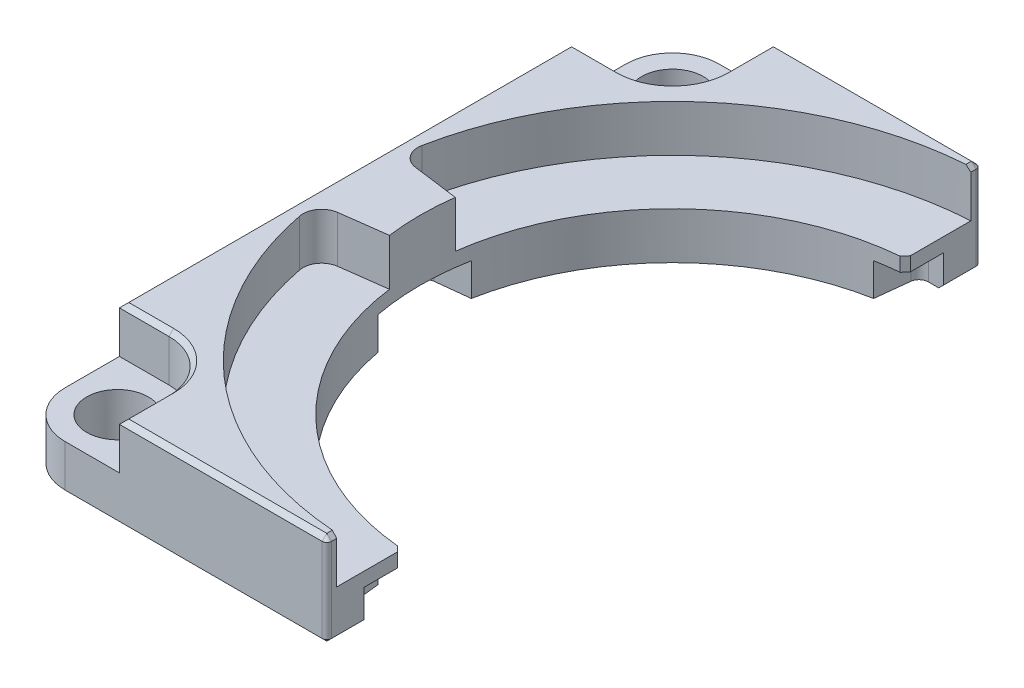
ISO-10303-21;
HEADER;
FILE_DESCRIPTION(('STEP AP214'),'2;1');
FILE_NAME('part.step','',(''),(''),'','','');
FILE_SCHEMA(('AUTOMOTIVE_DESIGN { 1 0 10303 214 1 1 1 1 }'));
ENDSEC;
DATA;
#1=APPLICATION_CONTEXT('core data for automotive mechanical design processes');
#2=APPLICATION_PROTOCOL_DEFINITION('international standard','automotive_design',2000,#1);
#3=PRODUCT_CONTEXT('',#1,'mechanical');
#4=PRODUCT('Part','Part','',(#3));
#5=PRODUCT_RELATED_PRODUCT_CATEGORY('part','',(#4));
#6=PRODUCT_DEFINITION_FORMATION('','',#4);
#7=PRODUCT_DEFINITION_CONTEXT('part definition',#1,'design');
#8=PRODUCT_DEFINITION('design','',#6,#7);
#9=PRODUCT_DEFINITION_SHAPE('','',#8);
#10=(LENGTH_UNIT() NAMED_UNIT(*) SI_UNIT(.MILLI.,.METRE.));
#11=(NAMED_UNIT(*) PLANE_ANGLE_UNIT() SI_UNIT($,.RADIAN.));
#12=(NAMED_UNIT(*) SI_UNIT($,.STERADIAN.) SOLID_ANGLE_UNIT());
#13=UNCERTAINTY_MEASURE_WITH_UNIT(LENGTH_MEASURE(1.E-05),#10,'distance_accuracy_value','');
#14=(GEOMETRIC_REPRESENTATION_CONTEXT(3) GLOBAL_UNCERTAINTY_ASSIGNED_CONTEXT((#13)) GLOBAL_UNIT_ASSIGNED_CONTEXT((#10,
#11,#12)) REPRESENTATION_CONTEXT('',''));
#15=CARTESIAN_POINT('',(0.,0.,0.));
#16=DIRECTION('',(0.,0.,1.));
#17=DIRECTION('',(1.,0.,0.));
#18=AXIS2_PLACEMENT_3D('',#15,#16,#17);
#19=CARTESIAN_POINT('',(-30.,10.,30.));
#20=DIRECTION('',(0.,-1.,0.));
#21=DIRECTION('',(0.,0.,-1.));
#22=AXIS2_PLACEMENT_3D('',#19,#20,#21);
#23=PLANE('',#22);
#24=CARTESIAN_POINT('',(0.,10.,0.));
#25=DIRECTION('',(0.,1.,0.));
#26=DIRECTION('',(0.,0.,1.));
#27=AXIS2_PLACEMENT_3D('',#24,#25,#26);
#28=CIRCLE('',#27,34.);
#29=CARTESIAN_POINT('',(-2.5,10.,-33.9079636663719));
#30=VERTEX_POINT('',#29);
#31=CARTESIAN_POINT('',(-33.3658545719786,10.,-6.53603462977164));
#32=VERTEX_POINT('',#31);
#33=EDGE_CURVE('E349',#30,#32,#28,.T.);
#34=ORIENTED_EDGE('',*,*,#33,.F.);
#35=DIRECTION('',(0.,0.,-1.));
#36=VECTOR('',#35,1.);
#37=CARTESIAN_POINT('',(-2.5,10.,30.));
#38=LINE('',#37,#36);
#39=CARTESIAN_POINT('',(-2.5,10.,-34.5));
#40=VERTEX_POINT('',#39);
#41=EDGE_CURVE('E634',#30,#40,#38,.T.);
#42=ORIENTED_EDGE('',*,*,#41,.T.);
#43=DIRECTION('',(-1.,0.,0.));
#44=VECTOR('',#43,1.);
#45=CARTESIAN_POINT('',(-30.,10.,-34.5));
#46=LINE('',#45,#44);
#47=CARTESIAN_POINT('',(-23.7,10.,-34.5));
#48=VERTEX_POINT('',#47);
#49=EDGE_CURVE('E632',#40,#48,#46,.T.);
#50=ORIENTED_EDGE('',*,*,#49,.T.);
#51=DIRECTION('',(0.,0.,1.));
#52=VECTOR('',#51,1.);
#53=CARTESIAN_POINT('',(-23.7,10.,-29.7));
#54=LINE('',#53,#52);
#55=CARTESIAN_POINT('',(-23.7,10.,-29.7));
#56=VERTEX_POINT('',#55);
#57=EDGE_CURVE('E630',#48,#56,#54,.T.);
#58=ORIENTED_EDGE('',*,*,#57,.T.);
#59=CARTESIAN_POINT('',(-29.7,10.,-29.7));
#60=DIRECTION('',(0.,-1.,0.));
#61=DIRECTION('',(0.,0.,-1.));
#62=AXIS2_PLACEMENT_3D('',#59,#60,#61);
#63=CIRCLE('',#62,6.);
#64=CARTESIAN_POINT('',(-29.7,10.,-23.7));
#65=VERTEX_POINT('',#64);
#66=EDGE_CURVE('E628',#56,#65,#63,.T.);
#67=ORIENTED_EDGE('',*,*,#66,.T.);
#68=DIRECTION('',(-1.,0.,0.));
#69=VECTOR('',#68,1.);
#70=CARTESIAN_POINT('',(-35.,10.,-23.7));
#71=LINE('',#70,#69);
#72=CARTESIAN_POINT('',(-34.5,10.,-23.7));
#73=VERTEX_POINT('',#72);
#74=EDGE_CURVE('E626',#65,#73,#71,.T.);
#75=ORIENTED_EDGE('',*,*,#74,.T.);
#76=DIRECTION('',(0.,0.,1.));
#77=VECTOR('',#76,1.);
#78=CARTESIAN_POINT('',(-34.5,10.,30.));
#79=LINE('',#78,#77);
#80=CARTESIAN_POINT('',(-34.5,10.,23.7));
#81=VERTEX_POINT('',#80);
#82=EDGE_CURVE('E624',#73,#81,#79,.T.);
#83=ORIENTED_EDGE('',*,*,#82,.T.);
#84=DIRECTION('',(1.,0.,0.));
#85=VECTOR('',#84,1.);
#86=CARTESIAN_POINT('',(-29.7,10.,23.7));
#87=LINE('',#86,#85);
#88=CARTESIAN_POINT('',(-29.7,10.,23.7));
#89=VERTEX_POINT('',#88);
#90=EDGE_CURVE('E622',#81,#89,#87,.T.);
#91=ORIENTED_EDGE('',*,*,#90,.T.);
#92=CARTESIAN_POINT('',(-29.7,10.,29.7));
#93=DIRECTION('',(0.,-1.,0.));
#94=DIRECTION('',(0.,0.,-1.));
#95=AXIS2_PLACEMENT_3D('',#92,#93,#94);
#96=CIRCLE('',#95,6.);
#97=CARTESIAN_POINT('',(-23.7,10.,29.7));
#98=VERTEX_POINT('',#97);
#99=EDGE_CURVE('E620',#89,#98,#96,.T.);
#100=ORIENTED_EDGE('',*,*,#99,.T.);
#101=DIRECTION('',(0.,0.,1.));
#102=VECTOR('',#101,1.);
#103=CARTESIAN_POINT('',(-23.7,10.,35.));
#104=LINE('',#103,#102);
#105=CARTESIAN_POINT('',(-23.7,10.,34.5));
#106=VERTEX_POINT('',#105);
#107=EDGE_CURVE('E618',#98,#106,#104,.T.);
#108=ORIENTED_EDGE('',*,*,#107,.T.);
#109=DIRECTION('',(1.,0.,0.));
#110=VECTOR('',#109,1.);
#111=CARTESIAN_POINT('',(-30.,10.,34.5));
#112=LINE('',#111,#110);
#113=CARTESIAN_POINT('',(-2.5,10.,34.5));
#114=VERTEX_POINT('',#113);
#115=EDGE_CURVE('E614',#106,#114,#112,.T.);
#116=ORIENTED_EDGE('',*,*,#115,.T.);
#117=DIRECTION('',(0.,0.,-1.));
#118=VECTOR('',#117,1.);
#119=CARTESIAN_POINT('',(-2.5,10.,30.));
#120=LINE('',#119,#118);
#121=CARTESIAN_POINT('',(-2.5,10.,33.9079636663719));
#122=VERTEX_POINT('',#121);
#123=EDGE_CURVE('E616',#114,#122,#120,.T.);
#124=ORIENTED_EDGE('',*,*,#123,.T.);
#125=CARTESIAN_POINT('',(0.,10.,0.));
#126=DIRECTION('',(0.,1.,0.));
#127=DIRECTION('',(0.,0.,1.));
#128=AXIS2_PLACEMENT_3D('',#125,#126,#127);
#129=CIRCLE('',#128,34.);
#130=CARTESIAN_POINT('',(-33.3658545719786,10.,6.53603462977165));
#131=VERTEX_POINT('',#130);
#132=EDGE_CURVE('E401',#131,#122,#129,.T.);
#133=ORIENTED_EDGE('',*,*,#132,.F.);
#134=CARTESIAN_POINT('',(-31.4031572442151,10.,6.15156200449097));
#135=DIRECTION('',(0.,1.,0.));
#136=DIRECTION('',(0.,0.,1.));
#137=AXIS2_PLACEMENT_3D('',#134,#135,#136);
#138=CIRCLE('',#137,2.);
#139=CARTESIAN_POINT('',(-31.6642096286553,10.,4.16867228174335));
#140=VERTEX_POINT('',#139);
#141=EDGE_CURVE('E398',#140,#131,#138,.T.);
#142=ORIENTED_EDGE('',*,*,#141,.F.);
#143=DIRECTION('',(-0.99144486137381,0.,0.130526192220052));
#144=VECTOR('',#143,1.);
#145=CARTESIAN_POINT('',(-26.7690112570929,10.,3.5242071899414));
#146=LINE('',#145,#144);
#147=CARTESIAN_POINT('',(-26.7690112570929,10.,3.5242071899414));
#148=VERTEX_POINT('',#147);
#149=EDGE_CURVE('E396',#148,#140,#146,.T.);
#150=ORIENTED_EDGE('',*,*,#149,.F.);
#151=CARTESIAN_POINT('',(0.,10.,0.));
#152=DIRECTION('',(0.,-1.,0.));
#153=DIRECTION('',(0.,0.,1.));
#154=AXIS2_PLACEMENT_3D('',#151,#152,#153);
#155=CIRCLE('',#154,27.);
#156=CARTESIAN_POINT('',(-26.7690112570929,10.,-3.5242071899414));
#157=VERTEX_POINT('',#156);
#158=EDGE_CURVE('E578',#148,#157,#155,.T.);
#159=ORIENTED_EDGE('',*,*,#158,.T.);
#160=DIRECTION('',(0.99144486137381,0.,0.130526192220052));
#161=VECTOR('',#160,1.);
#162=CARTESIAN_POINT('',(-26.7690112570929,10.,-3.5242071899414));
#163=LINE('',#162,#161);
#164=CARTESIAN_POINT('',(-31.6642096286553,10.,-4.16867228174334));
#165=VERTEX_POINT('',#164);
#166=EDGE_CURVE('E375',#165,#157,#163,.T.);
#167=ORIENTED_EDGE('',*,*,#166,.F.);
#168=CARTESIAN_POINT('',(-31.4031572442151,10.,-6.15156200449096));
#169=DIRECTION('',(0.,1.,0.));
#170=DIRECTION('',(0.,0.,-1.));
#171=AXIS2_PLACEMENT_3D('',#168,#169,#170);
#172=CIRCLE('',#171,2.);
#173=EDGE_CURVE('E362',#32,#165,#172,.T.);
#174=ORIENTED_EDGE('',*,*,#173,.F.);
#175=EDGE_LOOP('',(#34,#42,#50,#58,#67,#75,#83,#91,#100,#108,#116,#124,#133,#142,#150,#159,#167,#174));
#176=FACE_BOUND('',#175,.T.);
#177=ADVANCED_FACE('F17',(#176),#23,.F.);
#178=CARTESIAN_POINT('',(-2.,10.,35.));
#179=DIRECTION('',(-1.,0.,0.));
#180=DIRECTION('',(0.,0.,1.));
#181=AXIS2_PLACEMENT_3D('',#178,#179,#180);
#182=PLANE('',#181);
#183=DIRECTION('',(0.,0.,-1.));
#184=VECTOR('',#183,1.);
#185=CARTESIAN_POINT('',(-2.,3.5,35.));
#186=LINE('',#185,#184);
#187=CARTESIAN_POINT('',(-2.,3.5,31.));
#188=VERTEX_POINT('',#187);
#189=CARTESIAN_POINT('',(-2.,3.5,27.4258240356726));
#190=VERTEX_POINT('',#189);
#191=EDGE_CURVE('E574',#188,#190,#186,.T.);
#192=ORIENTED_EDGE('',*,*,#191,.T.);
#193=DIRECTION('',(0.,1.,0.));
#194=VECTOR('',#193,1.);
#195=CARTESIAN_POINT('',(-2.,10.,27.4258240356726));
#196=LINE('',#195,#194);
#197=CARTESIAN_POINT('',(-2.,5.,27.4258240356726));
#198=VERTEX_POINT('',#197);
#199=EDGE_CURVE('E680',#190,#198,#196,.T.);
#200=ORIENTED_EDGE('',*,*,#199,.T.);
#201=DIRECTION('',(0.,0.,-1.));
#202=VECTOR('',#201,1.);
#203=CARTESIAN_POINT('',(-2.,5.,26.9258240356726));
#204=LINE('',#203,#202);
#205=CARTESIAN_POINT('',(-2.,5.,33.9411254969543));
#206=VERTEX_POINT('',#205);
#207=EDGE_CURVE('E399',#206,#198,#204,.T.);
#208=ORIENTED_EDGE('',*,*,#207,.F.);
#209=DIRECTION('',(0.,-1.,0.));
#210=VECTOR('',#209,1.);
#211=CARTESIAN_POINT('',(-2.,10.,33.9411254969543));
#212=LINE('',#211,#210);
#213=CARTESIAN_POINT('',(-2.,9.5,33.9411254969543));
#214=VERTEX_POINT('',#213);
#215=EDGE_CURVE('E404',#214,#206,#212,.T.);
#216=ORIENTED_EDGE('',*,*,#215,.F.);
#217=DIRECTION('',(0.,0.,1.));
#218=VECTOR('',#217,1.);
#219=CARTESIAN_POINT('',(-2.,9.5,35.));
#220=LINE('',#219,#218);
#221=CARTESIAN_POINT('',(-2.,9.5,34.5));
#222=VERTEX_POINT('',#221);
#223=EDGE_CURVE('E678',#214,#222,#220,.T.);
#224=ORIENTED_EDGE('',*,*,#223,.T.);
#225=DIRECTION('',(0.,-1.,0.));
#226=VECTOR('',#225,1.);
#227=CARTESIAN_POINT('',(-2.,10.,34.5));
#228=LINE('',#227,#226);
#229=CARTESIAN_POINT('',(-2.,0.5,34.5));
#230=VERTEX_POINT('',#229);
#231=EDGE_CURVE('E599',#222,#230,#228,.T.);
#232=ORIENTED_EDGE('',*,*,#231,.T.);
#233=DIRECTION('',(0.,0.,-1.));
#234=VECTOR('',#233,1.);
#235=CARTESIAN_POINT('',(-2.,0.5,31.));
#236=LINE('',#235,#234);
#237=CARTESIAN_POINT('',(-2.,0.5,31.));
#238=VERTEX_POINT('',#237);
#239=EDGE_CURVE('E675',#230,#238,#236,.T.);
#240=ORIENTED_EDGE('',*,*,#239,.T.);
#241=DIRECTION('',(0.,-1.,0.));
#242=VECTOR('',#241,1.);
#243=CARTESIAN_POINT('',(-2.,10.,31.));
#244=LINE('',#243,#242);
#245=EDGE_CURVE('E524',#188,#238,#244,.T.);
#246=ORIENTED_EDGE('',*,*,#245,.F.);
#247=EDGE_LOOP('',(#192,#200,#208,#216,#224,#232,#240,#246));
#248=FACE_BOUND('',#247,.T.);
#249=ADVANCED_FACE('F849',(#248),#182,.F.);
#250=CARTESIAN_POINT('',(0.,10.,0.));
#251=DIRECTION('',(0.,-1.,0.));
#252=DIRECTION('',(0.,0.,-1.));
#253=AXIS2_PLACEMENT_3D('',#250,#251,#252);
#254=CYLINDRICAL_SURFACE('',#253,27.);
#255=CARTESIAN_POINT('',(0.,5.,0.));
#256=DIRECTION('',(0.,-1.,0.));
#257=DIRECTION('',(0.,0.,1.));
#258=AXIS2_PLACEMENT_3D('',#255,#256,#257);
#259=CIRCLE('',#258,27.);
#260=CARTESIAN_POINT('',(-2.54614498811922,5.,26.8796790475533));
#261=VERTEX_POINT('',#260);
#262=CARTESIAN_POINT('',(-26.7690112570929,5.,3.5242071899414));
#263=VERTEX_POINT('',#262);
#264=EDGE_CURVE('E405',#261,#263,#259,.T.);
#265=ORIENTED_EDGE('',*,*,#264,.F.);
#266=DIRECTION('',(0.,-1.,0.));
#267=VECTOR('',#266,1.);
#268=CARTESIAN_POINT('',(-2.54614498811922,10.,26.8796790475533));
#269=LINE('',#268,#267);
#270=CARTESIAN_POINT('',(-2.54614498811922,3.5,26.8796790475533));
#271=VERTEX_POINT('',#270);
#272=EDGE_CURVE('E670',#261,#271,#269,.T.);
#273=ORIENTED_EDGE('',*,*,#272,.T.);
#274=CARTESIAN_POINT('',(0.,3.5,0.));
#275=DIRECTION('',(0.,-1.,0.));
#276=DIRECTION('',(0.,0.,1.));
#277=AXIS2_PLACEMENT_3D('',#274,#275,#276);
#278=CIRCLE('',#277,27.);
#279=CARTESIAN_POINT('',(-5.00000000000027,3.5,26.5329983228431));
#280=VERTEX_POINT('',#279);
#281=EDGE_CURVE('E547',#271,#280,#278,.T.);
#282=ORIENTED_EDGE('',*,*,#281,.T.);
#283=DIRECTION('',(0.,-1.,0.));
#284=VECTOR('',#283,1.);
#285=CARTESIAN_POINT('',(-5.00000000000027,3.5,26.5329983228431));
#286=LINE('',#285,#284);
#287=CARTESIAN_POINT('',(-5.00000000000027,0.,26.5329983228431));
#288=VERTEX_POINT('',#287);
#289=EDGE_CURVE('E539',#280,#288,#286,.T.);
#290=ORIENTED_EDGE('',*,*,#289,.T.);
#291=CARTESIAN_POINT('',(0.,0.,0.));
#292=DIRECTION('',(0.,-1.,0.));
#293=DIRECTION('',(0.,0.,1.));
#294=AXIS2_PLACEMENT_3D('',#291,#292,#293);
#295=CIRCLE('',#294,27.);
#296=CARTESIAN_POINT('',(-26.5329983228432,0.,5.));
#297=VERTEX_POINT('',#296);
#298=EDGE_CURVE('E581',#288,#297,#295,.T.);
#299=ORIENTED_EDGE('',*,*,#298,.T.);
#300=DIRECTION('',(0.,-1.,0.));
#301=VECTOR('',#300,1.);
#302=CARTESIAN_POINT('',(-26.5329983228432,3.5,5.));
#303=LINE('',#302,#301);
#304=CARTESIAN_POINT('',(-26.5329983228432,3.5,5.));
#305=VERTEX_POINT('',#304);
#306=EDGE_CURVE('E496',#305,#297,#303,.T.);
#307=ORIENTED_EDGE('',*,*,#306,.F.);
#308=CARTESIAN_POINT('',(0.,3.5,0.));
#309=DIRECTION('',(0.,-1.,0.));
#310=DIRECTION('',(0.,0.,1.));
#311=AXIS2_PLACEMENT_3D('',#308,#309,#310);
#312=CIRCLE('',#311,27.);
#313=CARTESIAN_POINT('',(-26.5329983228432,3.5,-5.));
#314=VERTEX_POINT('',#313);
#315=EDGE_CURVE('E482',#305,#314,#312,.T.);
#316=ORIENTED_EDGE('',*,*,#315,.T.);
#317=DIRECTION('',(0.,-1.,0.));
#318=VECTOR('',#317,1.);
#319=CARTESIAN_POINT('',(-26.5329983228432,3.5,-5.));
#320=LINE('',#319,#318);
#321=CARTESIAN_POINT('',(-26.5329983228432,0.,-5.));
#322=VERTEX_POINT('',#321);
#323=EDGE_CURVE('E521',#314,#322,#320,.T.);
#324=ORIENTED_EDGE('',*,*,#323,.T.);
#325=CARTESIAN_POINT('',(-4.99999999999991,0.,-26.5329983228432));
#326=VERTEX_POINT('',#325);
#327=EDGE_CURVE('E577',#322,#326,#295,.T.);
#328=ORIENTED_EDGE('',*,*,#327,.T.);
#329=DIRECTION('',(0.,-1.,0.));
#330=VECTOR('',#329,1.);
#331=CARTESIAN_POINT('',(-4.99999999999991,3.5,-26.5329983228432));
#332=LINE('',#331,#330);
#333=CARTESIAN_POINT('',(-4.99999999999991,3.5,-26.5329983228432));
#334=VERTEX_POINT('',#333);
#335=EDGE_CURVE('E535',#334,#326,#332,.T.);
#336=ORIENTED_EDGE('',*,*,#335,.F.);
#337=CARTESIAN_POINT('',(0.,3.5,0.));
#338=DIRECTION('',(0.,-1.,0.));
#339=DIRECTION('',(0.,0.,1.));
#340=AXIS2_PLACEMENT_3D('',#337,#338,#339);
#341=CIRCLE('',#340,27.);
#342=CARTESIAN_POINT('',(-2.50298176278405,3.5,-26.8837326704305));
#343=VERTEX_POINT('',#342);
#344=EDGE_CURVE('E525',#334,#343,#341,.T.);
#345=ORIENTED_EDGE('',*,*,#344,.T.);
#346=DIRECTION('',(0.,-1.,0.));
#347=VECTOR('',#346,1.);
#348=CARTESIAN_POINT('',(-2.50298176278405,10.,-26.8837326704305));
#349=LINE('',#348,#347);
#350=CARTESIAN_POINT('',(-2.50298176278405,5.,-26.8837326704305));
#351=VERTEX_POINT('',#350);
#352=EDGE_CURVE('E668',#343,#351,#349,.F.);
#353=ORIENTED_EDGE('',*,*,#352,.T.);
#354=CARTESIAN_POINT('',(0.,5.,0.));
#355=DIRECTION('',(0.,-1.,0.));
#356=DIRECTION('',(0.,0.,1.));
#357=AXIS2_PLACEMENT_3D('',#354,#355,#356);
#358=CIRCLE('',#357,27.);
#359=CARTESIAN_POINT('',(-26.7690112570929,5.,-3.5242071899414));
#360=VERTEX_POINT('',#359);
#361=EDGE_CURVE('E380',#360,#351,#358,.T.);
#362=ORIENTED_EDGE('',*,*,#361,.F.);
#363=DIRECTION('',(0.,-1.,0.));
#364=VECTOR('',#363,1.);
#365=CARTESIAN_POINT('',(-26.7690112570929,10.,-3.5242071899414));
#366=LINE('',#365,#364);
#367=EDGE_CURVE('E377',#157,#360,#366,.T.);
#368=ORIENTED_EDGE('',*,*,#367,.F.);
#369=ORIENTED_EDGE('',*,*,#158,.F.);
#370=DIRECTION('',(0.,-1.,0.));
#371=VECTOR('',#370,1.);
#372=CARTESIAN_POINT('',(-26.7690112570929,10.,3.5242071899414));
#373=LINE('',#372,#371);
#374=EDGE_CURVE('E384',#148,#263,#373,.T.);
#375=ORIENTED_EDGE('',*,*,#374,.T.);
#376=EDGE_LOOP('',(#265,#273,#282,#290,#299,#307,#316,#324,#328,#336,#345,#353,#362,#368,#369,#375));
#377=FACE_BOUND('',#376,.T.);
#378=ADVANCED_FACE('F802',(#377),#254,.F.);
#379=CARTESIAN_POINT('',(-2.,10.,-35.));
#380=DIRECTION('',(-1.,0.,0.));
#381=DIRECTION('',(0.,0.,1.));
#382=AXIS2_PLACEMENT_3D('',#379,#380,#381);
#383=PLANE('',#382);
#384=DIRECTION('',(0.,-1.,0.));
#385=VECTOR('',#384,1.);
#386=CARTESIAN_POINT('',(-2.,10.,-34.5));
#387=LINE('',#386,#385);
#388=CARTESIAN_POINT('',(-2.,0.5,-34.5));
#389=VERTEX_POINT('',#388);
#390=CARTESIAN_POINT('',(-2.,9.5,-34.5));
#391=VERTEX_POINT('',#390);
#392=EDGE_CURVE('E611',#389,#391,#387,.F.);
#393=ORIENTED_EDGE('',*,*,#392,.T.);
#394=DIRECTION('',(0.,0.,1.));
#395=VECTOR('',#394,1.);
#396=CARTESIAN_POINT('',(-2.,9.5,-35.));
#397=LINE('',#396,#395);
#398=CARTESIAN_POINT('',(-2.,9.5,-33.9411254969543));
#399=VERTEX_POINT('',#398);
#400=EDGE_CURVE('E641',#391,#399,#397,.T.);
#401=ORIENTED_EDGE('',*,*,#400,.T.);
#402=DIRECTION('',(0.,-1.,0.));
#403=VECTOR('',#402,1.);
#404=CARTESIAN_POINT('',(-2.,10.,-33.9411254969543));
#405=LINE('',#404,#403);
#406=CARTESIAN_POINT('',(-2.,5.,-33.9411254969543));
#407=VERTEX_POINT('',#406);
#408=EDGE_CURVE('E370',#399,#407,#405,.T.);
#409=ORIENTED_EDGE('',*,*,#408,.T.);
#410=DIRECTION('',(0.,0.,-1.));
#411=VECTOR('',#410,1.);
#412=CARTESIAN_POINT('',(-2.,5.,-26.9258240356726));
#413=LINE('',#412,#411);
#414=CARTESIAN_POINT('',(-2.,5.,-27.4674310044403));
#415=VERTEX_POINT('',#414);
#416=EDGE_CURVE('E383',#415,#407,#413,.T.);
#417=ORIENTED_EDGE('',*,*,#416,.F.);
#418=DIRECTION('',(0.,-1.,0.));
#419=VECTOR('',#418,1.);
#420=CARTESIAN_POINT('',(-2.,10.,-27.4674310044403));
#421=LINE('',#420,#419);
#422=CARTESIAN_POINT('',(-2.,3.5,-27.4674310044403));
#423=VERTEX_POINT('',#422);
#424=EDGE_CURVE('E638',#415,#423,#421,.T.);
#425=ORIENTED_EDGE('',*,*,#424,.T.);
#426=DIRECTION('',(0.,0.,-1.));
#427=VECTOR('',#426,1.);
#428=CARTESIAN_POINT('',(-2.,3.5,-35.));
#429=LINE('',#428,#427);
#430=CARTESIAN_POINT('',(-2.,3.5,-31.));
#431=VERTEX_POINT('',#430);
#432=EDGE_CURVE('E596',#423,#431,#429,.T.);
#433=ORIENTED_EDGE('',*,*,#432,.T.);
#434=DIRECTION('',(0.,1.,0.));
#435=VECTOR('',#434,1.);
#436=CARTESIAN_POINT('',(-2.,10.,-31.));
#437=LINE('',#436,#435);
#438=CARTESIAN_POINT('',(-2.,0.5,-31.));
#439=VERTEX_POINT('',#438);
#440=EDGE_CURVE('E572',#439,#431,#437,.T.);
#441=ORIENTED_EDGE('',*,*,#440,.F.);
#442=DIRECTION('',(0.,0.,-1.));
#443=VECTOR('',#442,1.);
#444=CARTESIAN_POINT('',(-2.,0.5,-34.5));
#445=LINE('',#444,#443);
#446=EDGE_CURVE('E636',#439,#389,#445,.T.);
#447=ORIENTED_EDGE('',*,*,#446,.T.);
#448=EDGE_LOOP('',(#393,#401,#409,#417,#425,#433,#441,#447));
#449=FACE_BOUND('',#448,.T.);
#450=ADVANCED_FACE('F941',(#449),#383,.F.);
#451=CARTESIAN_POINT('',(-2.,10.,35.));
#452=DIRECTION('',(0.,0.,-1.));
#453=DIRECTION('',(-1.,0.,0.));
#454=AXIS2_PLACEMENT_3D('',#451,#452,#453);
#455=PLANE('',#454);
#456=DIRECTION('',(0.,-1.,0.));
#457=VECTOR('',#456,1.);
#458=CARTESIAN_POINT('',(-30.,10.,35.));
#459=LINE('',#458,#457);
#460=CARTESIAN_POINT('',(-30.,5.,35.));
#461=VERTEX_POINT('',#460);
#462=CARTESIAN_POINT('',(-30.,0.5,35.));
#463=VERTEX_POINT('',#462);
#464=EDGE_CURVE('E580',#461,#463,#459,.T.);
#465=ORIENTED_EDGE('',*,*,#464,.T.);
#466=DIRECTION('',(1.,0.,0.));
#467=VECTOR('',#466,1.);
#468=CARTESIAN_POINT('',(-2.5,0.5,35.));
#469=LINE('',#468,#467);
#470=CARTESIAN_POINT('',(-2.5,0.5,35.));
#471=VERTEX_POINT('',#470);
#472=EDGE_CURVE('E11',#463,#471,#469,.T.);
#473=ORIENTED_EDGE('',*,*,#472,.T.);
#474=DIRECTION('',(0.,-1.,0.));
#475=VECTOR('',#474,1.);
#476=CARTESIAN_POINT('',(-2.5,10.,35.));
#477=LINE('',#476,#475);
#478=CARTESIAN_POINT('',(-2.5,9.5,35.));
#479=VERTEX_POINT('',#478);
#480=EDGE_CURVE('E606',#471,#479,#477,.F.);
#481=ORIENTED_EDGE('',*,*,#480,.T.);
#482=DIRECTION('',(-1.,0.,0.));
#483=VECTOR('',#482,1.);
#484=CARTESIAN_POINT('',(-2.,9.5,35.));
#485=LINE('',#484,#483);
#486=CARTESIAN_POINT('',(-24.2,9.5,35.));
#487=VERTEX_POINT('',#486);
#488=EDGE_CURVE('E27',#479,#487,#485,.T.);
#489=ORIENTED_EDGE('',*,*,#488,.T.);
#490=DIRECTION('',(0.,-1.,0.));
#491=VECTOR('',#490,1.);
#492=CARTESIAN_POINT('',(-24.2,10.,35.));
#493=LINE('',#492,#491);
#494=CARTESIAN_POINT('',(-24.2,5.,35.));
#495=VERTEX_POINT('',#494);
#496=EDGE_CURVE('E469',#487,#495,#493,.T.);
#497=ORIENTED_EDGE('',*,*,#496,.T.);
#498=DIRECTION('',(1.,0.,0.));
#499=VECTOR('',#498,1.);
#500=CARTESIAN_POINT('',(-24.2,5.,35.));
#501=LINE('',#500,#499);
#502=EDGE_CURVE('E461',#461,#495,#501,.T.);
#503=ORIENTED_EDGE('',*,*,#502,.F.);
#504=EDGE_LOOP('',(#465,#473,#481,#489,#497,#503));
#505=FACE_BOUND('',#504,.T.);
#506=ADVANCED_FACE('F1007',(#505),#455,.F.);
#507=CARTESIAN_POINT('',(-2.,10.,-35.));
#508=DIRECTION('',(0.,0.,1.));
#509=DIRECTION('',(1.,0.,0.));
#510=AXIS2_PLACEMENT_3D('',#507,#508,#509);
#511=PLANE('',#510);
#512=DIRECTION('',(0.,-1.,0.));
#513=VECTOR('',#512,1.);
#514=CARTESIAN_POINT('',(-24.2,10.,-35.));
#515=LINE('',#514,#513);
#516=CARTESIAN_POINT('',(-24.2,9.5,-35.));
#517=VERTEX_POINT('',#516);
#518=CARTESIAN_POINT('',(-24.2,5.,-35.));
#519=VERTEX_POINT('',#518);
#520=EDGE_CURVE('E443',#517,#519,#515,.T.);
#521=ORIENTED_EDGE('',*,*,#520,.F.);
#522=DIRECTION('',(1.,0.,0.));
#523=VECTOR('',#522,1.);
#524=CARTESIAN_POINT('',(-2.,9.5,-35.));
#525=LINE('',#524,#523);
#526=CARTESIAN_POINT('',(-2.5,9.5,-35.));
#527=VERTEX_POINT('',#526);
#528=EDGE_CURVE('E654',#517,#527,#525,.T.);
#529=ORIENTED_EDGE('',*,*,#528,.T.);
#530=DIRECTION('',(0.,-1.,0.));
#531=VECTOR('',#530,1.);
#532=CARTESIAN_POINT('',(-2.5,10.,-35.));
#533=LINE('',#532,#531);
#534=CARTESIAN_POINT('',(-2.5,0.5,-35.));
#535=VERTEX_POINT('',#534);
#536=EDGE_CURVE('E608',#527,#535,#533,.T.);
#537=ORIENTED_EDGE('',*,*,#536,.T.);
#538=DIRECTION('',(-1.,0.,0.));
#539=VECTOR('',#538,1.);
#540=CARTESIAN_POINT('',(-30.,0.5,-35.));
#541=LINE('',#540,#539);
#542=CARTESIAN_POINT('',(-30.,0.5,-35.));
#543=VERTEX_POINT('',#542);
#544=EDGE_CURVE('E652',#535,#543,#541,.T.);
#545=ORIENTED_EDGE('',*,*,#544,.T.);
#546=DIRECTION('',(0.,-1.,0.));
#547=VECTOR('',#546,1.);
#548=CARTESIAN_POINT('',(-30.,10.,-35.));
#549=LINE('',#548,#547);
#550=CARTESIAN_POINT('',(-30.,5.,-35.));
#551=VERTEX_POINT('',#550);
#552=EDGE_CURVE('E591',#551,#543,#549,.T.);
#553=ORIENTED_EDGE('',*,*,#552,.F.);
#554=DIRECTION('',(-1.,0.,0.));
#555=VECTOR('',#554,1.);
#556=CARTESIAN_POINT('',(-24.2,5.,-35.));
#557=LINE('',#556,#555);
#558=EDGE_CURVE('E441',#519,#551,#557,.T.);
#559=ORIENTED_EDGE('',*,*,#558,.F.);
#560=EDGE_LOOP('',(#521,#529,#537,#545,#553,#559));
#561=FACE_BOUND('',#560,.T.);
#562=ADVANCED_FACE('F881',(#561),#511,.F.);
#563=CARTESIAN_POINT('',(-30.,10.,-30.));
#564=DIRECTION('',(0.,-1.,0.));
#565=DIRECTION('',(0.,0.,-1.));
#566=AXIS2_PLACEMENT_3D('',#563,#564,#565);
#567=CYLINDRICAL_SURFACE('',#566,5.);
#568=ORIENTED_EDGE('',*,*,#552,.T.);
#569=CARTESIAN_POINT('',(-30.,0.5,-30.));
#570=DIRECTION('',(0.,-1.,0.));
#571=DIRECTION('',(0.,0.,-1.));
#572=AXIS2_PLACEMENT_3D('',#569,#570,#571);
#573=CIRCLE('',#572,5.);
#574=CARTESIAN_POINT('',(-35.,0.5,-30.));
#575=VERTEX_POINT('',#574);
#576=EDGE_CURVE('E708',#543,#575,#573,.F.);
#577=ORIENTED_EDGE('',*,*,#576,.T.);
#578=DIRECTION('',(0.,-1.,0.));
#579=VECTOR('',#578,1.);
#580=CARTESIAN_POINT('',(-35.,10.,-30.));
#581=LINE('',#580,#579);
#582=CARTESIAN_POINT('',(-35.,5.,-30.));
#583=VERTEX_POINT('',#582);
#584=EDGE_CURVE('E588',#583,#575,#581,.T.);
#585=ORIENTED_EDGE('',*,*,#584,.F.);
#586=CARTESIAN_POINT('',(-30.,5.,-30.));
#587=DIRECTION('',(0.,1.,0.));
#588=DIRECTION('',(0.,0.,1.));
#589=AXIS2_PLACEMENT_3D('',#586,#587,#588);
#590=CIRCLE('',#589,5.);
#591=EDGE_CURVE('E426',#551,#583,#590,.T.);
#592=ORIENTED_EDGE('',*,*,#591,.F.);
#593=EDGE_LOOP('',(#568,#577,#585,#592));
#594=FACE_BOUND('',#593,.T.);
#595=ADVANCED_FACE('F886',(#594),#567,.T.);
#596=CARTESIAN_POINT('',(-35.,10.,-30.));
#597=DIRECTION('',(1.,0.,0.));
#598=DIRECTION('',(0.,0.,-1.));
#599=AXIS2_PLACEMENT_3D('',#596,#597,#598);
#600=PLANE('',#599);
#601=DIRECTION('',(0.,-1.,0.));
#602=VECTOR('',#601,1.);
#603=CARTESIAN_POINT('',(-35.,10.,24.2));
#604=LINE('',#603,#602);
#605=CARTESIAN_POINT('',(-35.,9.5,24.2));
#606=VERTEX_POINT('',#605);
#607=CARTESIAN_POINT('',(-35.,5.,24.2));
#608=VERTEX_POINT('',#607);
#609=EDGE_CURVE('E471',#606,#608,#604,.T.);
#610=ORIENTED_EDGE('',*,*,#609,.F.);
#611=DIRECTION('',(0.,0.,-1.));
#612=VECTOR('',#611,1.);
#613=CARTESIAN_POINT('',(-35.,9.5,-30.));
#614=LINE('',#613,#612);
#615=CARTESIAN_POINT('',(-35.,9.5,-24.2));
#616=VERTEX_POINT('',#615);
#617=EDGE_CURVE('E666',#606,#616,#614,.T.);
#618=ORIENTED_EDGE('',*,*,#617,.T.);
#619=DIRECTION('',(0.,-1.,0.));
#620=VECTOR('',#619,1.);
#621=CARTESIAN_POINT('',(-35.,10.,-24.2));
#622=LINE('',#621,#620);
#623=CARTESIAN_POINT('',(-35.,5.,-24.2));
#624=VERTEX_POINT('',#623);
#625=EDGE_CURVE('E449',#616,#624,#622,.T.);
#626=ORIENTED_EDGE('',*,*,#625,.T.);
#627=DIRECTION('',(0.,0.,1.));
#628=VECTOR('',#627,1.);
#629=CARTESIAN_POINT('',(-35.,5.,-30.));
#630=LINE('',#629,#628);
#631=EDGE_CURVE('E428',#583,#624,#630,.T.);
#632=ORIENTED_EDGE('',*,*,#631,.F.);
#633=ORIENTED_EDGE('',*,*,#584,.T.);
#634=DIRECTION('',(0.,0.,1.));
#635=VECTOR('',#634,1.);
#636=CARTESIAN_POINT('',(-35.,0.5,30.));
#637=LINE('',#636,#635);
#638=CARTESIAN_POINT('',(-35.,0.5,30.));
#639=VERTEX_POINT('',#638);
#640=EDGE_CURVE('E664',#575,#639,#637,.T.);
#641=ORIENTED_EDGE('',*,*,#640,.T.);
#642=DIRECTION('',(0.,-1.,0.));
#643=VECTOR('',#642,1.);
#644=CARTESIAN_POINT('',(-35.,10.,30.));
#645=LINE('',#644,#643);
#646=CARTESIAN_POINT('',(-35.,5.,30.));
#647=VERTEX_POINT('',#646);
#648=EDGE_CURVE('E585',#647,#639,#645,.T.);
#649=ORIENTED_EDGE('',*,*,#648,.F.);
#650=DIRECTION('',(0.,0.,1.));
#651=VECTOR('',#650,1.);
#652=CARTESIAN_POINT('',(-35.,5.,30.));
#653=LINE('',#652,#651);
#654=EDGE_CURVE('E457',#608,#647,#653,.T.);
#655=ORIENTED_EDGE('',*,*,#654,.F.);
#656=EDGE_LOOP('',(#610,#618,#626,#632,#633,#641,#649,#655));
#657=FACE_BOUND('',#656,.T.);
#658=ADVANCED_FACE('F895',(#657),#600,.F.);
#659=CARTESIAN_POINT('',(-29.7,10.,-29.7));
#660=DIRECTION('',(0.,1.,0.));
#661=DIRECTION('',(0.,0.,1.));
#662=AXIS2_PLACEMENT_3D('',#659,#660,#661);
#663=CYLINDRICAL_SURFACE('',#662,3.3);
#664=CARTESIAN_POINT('',(-29.7,0.,-29.7));
#665=DIRECTION('',(0.,1.,0.));
#666=DIRECTION('',(0.,0.,1.));
#667=AXIS2_PLACEMENT_3D('',#664,#665,#666);
#668=CIRCLE('',#667,3.3);
#669=CARTESIAN_POINT('',(-29.7,0.,-26.4));
#670=VERTEX_POINT('',#669);
#671=EDGE_CURVE('E474',#670,#670,#668,.T.);
#672=ORIENTED_EDGE('',*,*,#671,.F.);
#673=EDGE_LOOP('',(#672));
#674=FACE_BOUND('',#673,.T.);
#675=CARTESIAN_POINT('',(-29.7,5.,-29.7));
#676=DIRECTION('',(0.,1.,0.));
#677=DIRECTION('',(0.,0.,1.));
#678=AXIS2_PLACEMENT_3D('',#675,#676,#677);
#679=CIRCLE('',#678,3.3);
#680=CARTESIAN_POINT('',(-29.7,5.,-26.4));
#681=VERTEX_POINT('',#680);
#682=EDGE_CURVE('E451',#681,#681,#679,.F.);
#683=ORIENTED_EDGE('',*,*,#682,.F.);
#684=EDGE_LOOP('',(#683));
#685=FACE_BOUND('',#684,.T.);
#686=ADVANCED_FACE('F996',(#674,#685),#663,.F.);
#687=CARTESIAN_POINT('',(-30.,0.,30.));
#688=DIRECTION('',(0.,-1.,0.));
#689=DIRECTION('',(0.,0.,-1.));
#690=AXIS2_PLACEMENT_3D('',#687,#688,#689);
#691=PLANE('',#690);
#692=DIRECTION('',(1.,0.,0.));
#693=VECTOR('',#692,1.);
#694=CARTESIAN_POINT('',(-3.60568702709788,0.,31.));
#695=LINE('',#694,#693);
#696=CARTESIAN_POINT('',(-3.60568702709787,0.,31.));
#697=VERTEX_POINT('',#696);
#698=CARTESIAN_POINT('',(-2.5,0.,31.));
#699=VERTEX_POINT('',#698);
#700=EDGE_CURVE('E550',#697,#699,#695,.T.);
#701=ORIENTED_EDGE('',*,*,#700,.T.);
#702=DIRECTION('',(0.,0.,1.));
#703=VECTOR('',#702,1.);
#704=CARTESIAN_POINT('',(-2.5,0.,34.5));
#705=LINE('',#704,#703);
#706=CARTESIAN_POINT('',(-2.5,0.,34.5));
#707=VERTEX_POINT('',#706);
#708=EDGE_CURVE('E704',#699,#707,#705,.T.);
#709=ORIENTED_EDGE('',*,*,#708,.T.);
#710=DIRECTION('',(-1.,0.,0.));
#711=VECTOR('',#710,1.);
#712=CARTESIAN_POINT('',(-30.,0.,34.5));
#713=LINE('',#712,#711);
#714=CARTESIAN_POINT('',(-30.,0.,34.5));
#715=VERTEX_POINT('',#714);
#716=EDGE_CURVE('E692',#707,#715,#713,.T.);
#717=ORIENTED_EDGE('',*,*,#716,.T.);
#718=CARTESIAN_POINT('',(-30.,0.,30.));
#719=DIRECTION('',(0.,-1.,0.));
#720=DIRECTION('',(0.,0.,-1.));
#721=AXIS2_PLACEMENT_3D('',#718,#719,#720);
#722=CIRCLE('',#721,4.5);
#723=CARTESIAN_POINT('',(-34.5,0.,30.));
#724=VERTEX_POINT('',#723);
#725=EDGE_CURVE('E694',#715,#724,#722,.T.);
#726=ORIENTED_EDGE('',*,*,#725,.T.);
#727=DIRECTION('',(0.,0.,-1.));
#728=VECTOR('',#727,1.);
#729=CARTESIAN_POINT('',(-34.5,0.,-30.));
#730=LINE('',#729,#728);
#731=CARTESIAN_POINT('',(-34.5,0.,-30.));
#732=VERTEX_POINT('',#731);
#733=EDGE_CURVE('E696',#724,#732,#730,.T.);
#734=ORIENTED_EDGE('',*,*,#733,.T.);
#735=CARTESIAN_POINT('',(-30.,0.,-30.));
#736=DIRECTION('',(0.,-1.,0.));
#737=DIRECTION('',(0.,0.,-1.));
#738=AXIS2_PLACEMENT_3D('',#735,#736,#737);
#739=CIRCLE('',#738,4.5);
#740=CARTESIAN_POINT('',(-30.,0.,-34.5));
#741=VERTEX_POINT('',#740);
#742=EDGE_CURVE('E698',#732,#741,#739,.T.);
#743=ORIENTED_EDGE('',*,*,#742,.T.);
#744=DIRECTION('',(1.,0.,0.));
#745=VECTOR('',#744,1.);
#746=CARTESIAN_POINT('',(-2.5,0.,-34.5));
#747=LINE('',#746,#745);
#748=CARTESIAN_POINT('',(-2.5,0.,-34.5));
#749=VERTEX_POINT('',#748);
#750=EDGE_CURVE('E700',#741,#749,#747,.T.);
#751=ORIENTED_EDGE('',*,*,#750,.T.);
#752=DIRECTION('',(0.,0.,1.));
#753=VECTOR('',#752,1.);
#754=CARTESIAN_POINT('',(-2.5,0.,-31.));
#755=LINE('',#754,#753);
#756=CARTESIAN_POINT('',(-2.5,0.,-31.));
#757=VERTEX_POINT('',#756);
#758=EDGE_CURVE('E702',#749,#757,#755,.T.);
#759=ORIENTED_EDGE('',*,*,#758,.T.);
#760=DIRECTION('',(-1.,0.,0.));
#761=VECTOR('',#760,1.);
#762=CARTESIAN_POINT('',(-30.,0.,-31.));
#763=LINE('',#762,#761);
#764=CARTESIAN_POINT('',(-3.60568702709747,0.,-31.));
#765=VERTEX_POINT('',#764);
#766=EDGE_CURVE('E594',#757,#765,#763,.T.);
#767=ORIENTED_EDGE('',*,*,#766,.T.);
#768=CARTESIAN_POINT('',(-3.60568702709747,0.,-30.));
#769=DIRECTION('',(0.,1.,0.));
#770=DIRECTION('',(0.,0.,-1.));
#771=AXIS2_PLACEMENT_3D('',#768,#769,#770);
#772=CIRCLE('',#771,1.);
#773=CARTESIAN_POINT('',(-4.5994809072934,0.,-30.1112372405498));
#774=VERTEX_POINT('',#773);
#775=EDGE_CURVE('E536',#765,#774,#772,.T.);
#776=ORIENTED_EDGE('',*,*,#775,.T.);
#777=DIRECTION('',(-0.111237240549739,0.,0.993793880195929));
#778=VECTOR('',#777,1.);
#779=CARTESIAN_POINT('',(-4.99999999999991,0.,-26.5329983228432));
#780=LINE('',#779,#778);
#781=EDGE_CURVE('E529',#774,#326,#780,.T.);
#782=ORIENTED_EDGE('',*,*,#781,.T.);
#783=ORIENTED_EDGE('',*,*,#327,.F.);
#784=DIRECTION('',(-0.993793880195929,0.,0.111237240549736));
#785=VECTOR('',#784,1.);
#786=CARTESIAN_POINT('',(-26.5329983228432,0.,-5.));
#787=LINE('',#786,#785);
#788=CARTESIAN_POINT('',(-30.1112372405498,0.,-4.59948090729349));
#789=VERTEX_POINT('',#788);
#790=EDGE_CURVE('E497',#322,#789,#787,.T.);
#791=ORIENTED_EDGE('',*,*,#790,.T.);
#792=CARTESIAN_POINT('',(-30.,0.,-3.60568702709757));
#793=DIRECTION('',(0.,1.,0.));
#794=DIRECTION('',(0.,0.,1.));
#795=AXIS2_PLACEMENT_3D('',#792,#793,#794);
#796=CIRCLE('',#795,1.);
#797=CARTESIAN_POINT('',(-31.,0.,-3.60568702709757));
#798=VERTEX_POINT('',#797);
#799=EDGE_CURVE('E500',#789,#798,#796,.T.);
#800=ORIENTED_EDGE('',*,*,#799,.T.);
#801=DIRECTION('',(0.,0.,1.));
#802=VECTOR('',#801,1.);
#803=CARTESIAN_POINT('',(-31.,0.,-3.60568702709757));
#804=LINE('',#803,#802);
#805=CARTESIAN_POINT('',(-31.,0.,3.60568702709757));
#806=VERTEX_POINT('',#805);
#807=EDGE_CURVE('E504',#798,#806,#804,.T.);
#808=ORIENTED_EDGE('',*,*,#807,.T.);
#809=CARTESIAN_POINT('',(-30.,0.,3.60568702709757));
#810=DIRECTION('',(0.,1.,0.));
#811=DIRECTION('',(0.,0.,-1.));
#812=AXIS2_PLACEMENT_3D('',#809,#810,#811);
#813=CIRCLE('',#812,1.);
#814=CARTESIAN_POINT('',(-30.1112372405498,0.,4.5994809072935));
#815=VERTEX_POINT('',#814);
#816=EDGE_CURVE('E507',#806,#815,#813,.T.);
#817=ORIENTED_EDGE('',*,*,#816,.T.);
#818=DIRECTION('',(0.993793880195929,0.,0.111237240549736));
#819=VECTOR('',#818,1.);
#820=CARTESIAN_POINT('',(-26.5329983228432,0.,5.));
#821=LINE('',#820,#819);
#822=EDGE_CURVE('E486',#815,#297,#821,.T.);
#823=ORIENTED_EDGE('',*,*,#822,.T.);
#824=ORIENTED_EDGE('',*,*,#298,.F.);
#825=DIRECTION('',(0.111237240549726,0.,0.99379388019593));
#826=VECTOR('',#825,1.);
#827=CARTESIAN_POINT('',(-5.00000000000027,0.,26.5329983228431));
#828=LINE('',#827,#826);
#829=CARTESIAN_POINT('',(-4.5994809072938,0.,30.1112372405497));
#830=VERTEX_POINT('',#829);
#831=EDGE_CURVE('E481',#288,#830,#828,.T.);
#832=ORIENTED_EDGE('',*,*,#831,.T.);
#833=CARTESIAN_POINT('',(-3.60568702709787,0.,30.));
#834=DIRECTION('',(0.,1.,0.));
#835=DIRECTION('',(0.,0.,1.));
#836=AXIS2_PLACEMENT_3D('',#833,#834,#835);
#837=CIRCLE('',#836,1.);
#838=EDGE_CURVE('E560',#830,#697,#837,.T.);
#839=ORIENTED_EDGE('',*,*,#838,.T.);
#840=EDGE_LOOP('',(#701,#709,#717,#726,#734,#743,#751,#759,#767,#776,#782,#783,#791,#800,#808,
#817,#823,#824,#832,#839));
#841=FACE_BOUND('',#840,.T.);
#842=ORIENTED_EDGE('',*,*,#671,.T.);
#843=EDGE_LOOP('',(#842));
#844=FACE_BOUND('',#843,.T.);
#845=CARTESIAN_POINT('',(-29.7,0.,29.7));
#846=DIRECTION('',(0.,1.,0.));
#847=DIRECTION('',(0.,0.,1.));
#848=AXIS2_PLACEMENT_3D('',#845,#846,#847);
#849=CIRCLE('',#848,3.3);
#850=CARTESIAN_POINT('',(-29.7,0.,33.));
#851=VERTEX_POINT('',#850);
#852=EDGE_CURVE('E477',#851,#851,#849,.T.);
#853=ORIENTED_EDGE('',*,*,#852,.T.);
#854=EDGE_LOOP('',(#853));
#855=FACE_BOUND('',#854,.T.);
#856=ADVANCED_FACE('F784',(#841,#844,#855),#691,.T.);
#857=CARTESIAN_POINT('',(-30.,10.,30.));
#858=DIRECTION('',(0.,-1.,0.));
#859=DIRECTION('',(0.,0.,-1.));
#860=AXIS2_PLACEMENT_3D('',#857,#858,#859);
#861=CYLINDRICAL_SURFACE('',#860,5.);
#862=ORIENTED_EDGE('',*,*,#648,.T.);
#863=CARTESIAN_POINT('',(-30.,0.5,30.));
#864=DIRECTION('',(0.,-1.,0.));
#865=DIRECTION('',(0.,0.,-1.));
#866=AXIS2_PLACEMENT_3D('',#863,#864,#865);
#867=CIRCLE('',#866,5.);
#868=EDGE_CURVE('E710',#639,#463,#867,.F.);
#869=ORIENTED_EDGE('',*,*,#868,.T.);
#870=ORIENTED_EDGE('',*,*,#464,.F.);
#871=CARTESIAN_POINT('',(-30.,5.,30.));
#872=DIRECTION('',(0.,1.,0.));
#873=DIRECTION('',(0.,0.,-1.));
#874=AXIS2_PLACEMENT_3D('',#871,#872,#873);
#875=CIRCLE('',#874,5.);
#876=EDGE_CURVE('E459',#647,#461,#875,.T.);
#877=ORIENTED_EDGE('',*,*,#876,.F.);
#878=EDGE_LOOP('',(#862,#869,#870,#877));
#879=FACE_BOUND('',#878,.T.);
#880=ADVANCED_FACE('F995',(#879),#861,.T.);
#881=CARTESIAN_POINT('',(0.,3.5,0.));
#882=DIRECTION('',(0.,1.,0.));
#883=DIRECTION('',(0.,0.,1.));
#884=AXIS2_PLACEMENT_3D('',#881,#882,#883);
#885=PLANE('',#884);
#886=ORIENTED_EDGE('',*,*,#281,.F.);
#887=DIRECTION('',(-0.707106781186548,0.,-0.707106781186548));
#888=VECTOR('',#887,1.);
#889=CARTESIAN_POINT('',(-2.54614498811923,3.5,26.8796790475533));
#890=LINE('',#889,#888);
#891=EDGE_CURVE('E673',#271,#190,#890,.F.);
#892=ORIENTED_EDGE('',*,*,#891,.T.);
#893=ORIENTED_EDGE('',*,*,#191,.F.);
#894=DIRECTION('',(1.,0.,0.));
#895=VECTOR('',#894,1.);
#896=CARTESIAN_POINT('',(-3.60568702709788,3.5,31.));
#897=LINE('',#896,#895);
#898=CARTESIAN_POINT('',(-3.60568702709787,3.5,31.));
#899=VERTEX_POINT('',#898);
#900=EDGE_CURVE('E554',#899,#188,#897,.T.);
#901=ORIENTED_EDGE('',*,*,#900,.F.);
#902=CARTESIAN_POINT('',(-3.60568702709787,3.5,30.));
#903=DIRECTION('',(0.,1.,0.));
#904=DIRECTION('',(0.,0.,1.));
#905=AXIS2_PLACEMENT_3D('',#902,#903,#904);
#906=CIRCLE('',#905,1.);
#907=CARTESIAN_POINT('',(-4.5994809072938,3.5,30.1112372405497));
#908=VERTEX_POINT('',#907);
#909=EDGE_CURVE('E552',#908,#899,#906,.T.);
#910=ORIENTED_EDGE('',*,*,#909,.F.);
#911=DIRECTION('',(0.111237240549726,0.,0.99379388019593));
#912=VECTOR('',#911,1.);
#913=CARTESIAN_POINT('',(-5.00000000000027,3.5,26.5329983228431));
#914=LINE('',#913,#912);
#915=EDGE_CURVE('E549',#280,#908,#914,.T.);
#916=ORIENTED_EDGE('',*,*,#915,.F.);
#917=EDGE_LOOP('',(#886,#892,#893,#901,#910,#916));
#918=FACE_BOUND('',#917,.T.);
#919=ADVANCED_FACE('F999',(#918),#885,.F.);
#920=CARTESIAN_POINT('',(-3.60568702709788,3.5,31.));
#921=DIRECTION('',(0.,0.,-1.));
#922=DIRECTION('',(-1.,0.,0.));
#923=AXIS2_PLACEMENT_3D('',#920,#921,#922);
#924=PLANE('',#923);
#925=ORIENTED_EDGE('',*,*,#245,.T.);
#926=DIRECTION('',(-0.707106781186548,-0.707106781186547,0.));
#927=VECTOR('',#926,1.);
#928=CARTESIAN_POINT('',(-1.30284351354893,1.19715648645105,31.));
#929=LINE('',#928,#927);
#930=EDGE_CURVE('E690',#238,#699,#929,.T.);
#931=ORIENTED_EDGE('',*,*,#930,.T.);
#932=ORIENTED_EDGE('',*,*,#700,.F.);
#933=DIRECTION('',(0.,-1.,0.));
#934=VECTOR('',#933,1.);
#935=CARTESIAN_POINT('',(-3.60568702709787,3.5,31.));
#936=LINE('',#935,#934);
#937=EDGE_CURVE('E557',#899,#697,#936,.T.);
#938=ORIENTED_EDGE('',*,*,#937,.F.);
#939=ORIENTED_EDGE('',*,*,#900,.T.);
#940=EDGE_LOOP('',(#925,#931,#932,#938,#939));
#941=FACE_BOUND('',#940,.T.);
#942=ADVANCED_FACE('F843',(#941),#924,.T.);
#943=CARTESIAN_POINT('',(-5.00000000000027,3.5,26.5329983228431));
#944=DIRECTION('',(0.99379388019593,0.,-0.111237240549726));
#945=DIRECTION('',(-0.111237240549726,0.,-0.99379388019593));
#946=AXIS2_PLACEMENT_3D('',#943,#944,#945);
#947=PLANE('',#946);
#948=ORIENTED_EDGE('',*,*,#831,.F.);
#949=ORIENTED_EDGE('',*,*,#289,.F.);
#950=ORIENTED_EDGE('',*,*,#915,.T.);
#951=DIRECTION('',(0.,-1.,0.));
#952=VECTOR('',#951,1.);
#953=CARTESIAN_POINT('',(-4.5994809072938,3.5,30.1112372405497));
#954=LINE('',#953,#952);
#955=EDGE_CURVE('E566',#908,#830,#954,.T.);
#956=ORIENTED_EDGE('',*,*,#955,.T.);
#957=EDGE_LOOP('',(#948,#949,#950,#956));
#958=FACE_BOUND('',#957,.T.);
#959=ADVANCED_FACE('F832',(#958),#947,.T.);
#960=CARTESIAN_POINT('',(-3.60568702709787,3.5,30.));
#961=DIRECTION('',(0.,-1.,0.));
#962=DIRECTION('',(0.,0.,-1.));
#963=AXIS2_PLACEMENT_3D('',#960,#961,#962);
#964=CYLINDRICAL_SURFACE('',#963,1.);
#965=ORIENTED_EDGE('',*,*,#838,.F.);
#966=ORIENTED_EDGE('',*,*,#955,.F.);
#967=ORIENTED_EDGE('',*,*,#909,.T.);
#968=ORIENTED_EDGE('',*,*,#937,.T.);
#969=EDGE_LOOP('',(#965,#966,#967,#968));
#970=FACE_BOUND('',#969,.T.);
#971=ADVANCED_FACE('F838',(#970),#964,.F.);
#972=CARTESIAN_POINT('',(0.,3.5,0.));
#973=DIRECTION('',(0.,1.,0.));
#974=DIRECTION('',(0.,0.,1.));
#975=AXIS2_PLACEMENT_3D('',#972,#973,#974);
#976=PLANE('',#975);
#977=ORIENTED_EDGE('',*,*,#432,.F.);
#978=DIRECTION('',(0.652785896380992,0.,-0.75754245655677));
#979=VECTOR('',#978,1.);
#980=CARTESIAN_POINT('',(-2.,3.5,-27.4674310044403));
#981=LINE('',#980,#979);
#982=EDGE_CURVE('E684',#423,#343,#981,.F.);
#983=ORIENTED_EDGE('',*,*,#982,.T.);
#984=ORIENTED_EDGE('',*,*,#344,.F.);
#985=DIRECTION('',(-0.111237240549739,0.,0.993793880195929));
#986=VECTOR('',#985,1.);
#987=CARTESIAN_POINT('',(-4.99999999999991,3.5,-26.5329983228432));
#988=LINE('',#987,#986);
#989=CARTESIAN_POINT('',(-4.5994809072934,3.5,-30.1112372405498));
#990=VERTEX_POINT('',#989);
#991=EDGE_CURVE('E533',#990,#334,#988,.T.);
#992=ORIENTED_EDGE('',*,*,#991,.F.);
#993=CARTESIAN_POINT('',(-3.60568702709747,3.5,-30.));
#994=DIRECTION('',(0.,1.,0.));
#995=DIRECTION('',(0.,0.,-1.));
#996=AXIS2_PLACEMENT_3D('',#993,#994,#995);
#997=CIRCLE('',#996,1.);
#998=CARTESIAN_POINT('',(-3.60568702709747,3.5,-31.));
#999=VERTEX_POINT('',#998);
#1000=EDGE_CURVE('E531',#999,#990,#997,.T.);
#1001=ORIENTED_EDGE('',*,*,#1000,.F.);
#1002=DIRECTION('',(-1.,0.,0.));
#1003=VECTOR('',#1002,1.);
#1004=CARTESIAN_POINT('',(3.60568702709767,3.5,-31.));
#1005=LINE('',#1004,#1003);
#1006=EDGE_CURVE('E528',#431,#999,#1005,.T.);
#1007=ORIENTED_EDGE('',*,*,#1006,.F.);
#1008=EDGE_LOOP('',(#977,#983,#984,#992,#1001,#1007));
#1009=FACE_BOUND('',#1008,.T.);
#1010=ADVANCED_FACE('F1466',(#1009),#976,.F.);
#1011=CARTESIAN_POINT('',(3.60568702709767,3.5,-31.));
#1012=DIRECTION('',(0.,0.,1.));
#1013=DIRECTION('',(1.,0.,0.));
#1014=AXIS2_PLACEMENT_3D('',#1011,#1012,#1013);
#1015=PLANE('',#1014);
#1016=ORIENTED_EDGE('',*,*,#766,.F.);
#1017=DIRECTION('',(0.707106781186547,0.707106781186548,0.));
#1018=VECTOR('',#1017,1.);
#1019=CARTESIAN_POINT('',(2.30284351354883,4.80284351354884,-31.));
#1020=LINE('',#1019,#1018);
#1021=EDGE_CURVE('E706',#757,#439,#1020,.T.);
#1022=ORIENTED_EDGE('',*,*,#1021,.T.);
#1023=ORIENTED_EDGE('',*,*,#440,.T.);
#1024=ORIENTED_EDGE('',*,*,#1006,.T.);
#1025=DIRECTION('',(0.,-1.,0.));
#1026=VECTOR('',#1025,1.);
#1027=CARTESIAN_POINT('',(-3.60568702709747,3.5,-31.));
#1028=LINE('',#1027,#1026);
#1029=EDGE_CURVE('E501',#999,#765,#1028,.T.);
#1030=ORIENTED_EDGE('',*,*,#1029,.T.);
#1031=EDGE_LOOP('',(#1016,#1022,#1023,#1024,#1030));
#1032=FACE_BOUND('',#1031,.T.);
#1033=ADVANCED_FACE('F787',(#1032),#1015,.T.);
#1034=CARTESIAN_POINT('',(-3.60568702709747,3.5,-30.));
#1035=DIRECTION('',(0.,-1.,0.));
#1036=DIRECTION('',(0.,0.,-1.));
#1037=AXIS2_PLACEMENT_3D('',#1034,#1035,#1036);
#1038=CYLINDRICAL_SURFACE('',#1037,1.);
#1039=ORIENTED_EDGE('',*,*,#775,.F.);
#1040=ORIENTED_EDGE('',*,*,#1029,.F.);
#1041=ORIENTED_EDGE('',*,*,#1000,.T.);
#1042=DIRECTION('',(0.,-1.,0.));
#1043=VECTOR('',#1042,1.);
#1044=CARTESIAN_POINT('',(-4.5994809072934,3.5,-30.1112372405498));
#1045=LINE('',#1044,#1043);
#1046=EDGE_CURVE('E543',#990,#774,#1045,.T.);
#1047=ORIENTED_EDGE('',*,*,#1046,.T.);
#1048=EDGE_LOOP('',(#1039,#1040,#1041,#1047));
#1049=FACE_BOUND('',#1048,.T.);
#1050=ADVANCED_FACE('F794',(#1049),#1038,.F.);
#1051=CARTESIAN_POINT('',(-4.99999999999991,3.5,-26.5329983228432));
#1052=DIRECTION('',(0.993793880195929,0.,0.111237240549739));
#1053=DIRECTION('',(0.111237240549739,0.,-0.993793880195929));
#1054=AXIS2_PLACEMENT_3D('',#1051,#1052,#1053);
#1055=PLANE('',#1054);
#1056=ORIENTED_EDGE('',*,*,#781,.F.);
#1057=ORIENTED_EDGE('',*,*,#1046,.F.);
#1058=ORIENTED_EDGE('',*,*,#991,.T.);
#1059=ORIENTED_EDGE('',*,*,#335,.T.);
#1060=EDGE_LOOP('',(#1056,#1057,#1058,#1059));
#1061=FACE_BOUND('',#1060,.T.);
#1062=ADVANCED_FACE('F1441',(#1061),#1055,.T.);
#1063=CARTESIAN_POINT('',(-26.5329983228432,3.5,-5.));
#1064=DIRECTION('',(0.111237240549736,0.,0.993793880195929));
#1065=DIRECTION('',(0.993793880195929,0.,-0.111237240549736));
#1066=AXIS2_PLACEMENT_3D('',#1063,#1064,#1065);
#1067=PLANE('',#1066);
#1068=ORIENTED_EDGE('',*,*,#790,.F.);
#1069=ORIENTED_EDGE('',*,*,#323,.F.);
#1070=DIRECTION('',(-0.993793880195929,0.,0.111237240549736));
#1071=VECTOR('',#1070,1.);
#1072=CARTESIAN_POINT('',(-26.5329983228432,3.5,-5.));
#1073=LINE('',#1072,#1071);
#1074=CARTESIAN_POINT('',(-30.1112372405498,3.5,-4.59948090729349));
#1075=VERTEX_POINT('',#1074);
#1076=EDGE_CURVE('E485',#314,#1075,#1073,.T.);
#1077=ORIENTED_EDGE('',*,*,#1076,.T.);
#1078=DIRECTION('',(0.,-1.,0.));
#1079=VECTOR('',#1078,1.);
#1080=CARTESIAN_POINT('',(-30.1112372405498,3.5,-4.59948090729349));
#1081=LINE('',#1080,#1079);
#1082=EDGE_CURVE('E519',#1075,#789,#1081,.T.);
#1083=ORIENTED_EDGE('',*,*,#1082,.T.);
#1084=EDGE_LOOP('',(#1068,#1069,#1077,#1083));
#1085=FACE_BOUND('',#1084,.T.);
#1086=ADVANCED_FACE('F807',(#1085),#1067,.T.);
#1087=CARTESIAN_POINT('',(-30.,3.5,-3.60568702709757));
#1088=DIRECTION('',(0.,-1.,0.));
#1089=DIRECTION('',(0.,0.,-1.));
#1090=AXIS2_PLACEMENT_3D('',#1087,#1088,#1089);
#1091=CYLINDRICAL_SURFACE('',#1090,1.);
#1092=ORIENTED_EDGE('',*,*,#799,.F.);
#1093=ORIENTED_EDGE('',*,*,#1082,.F.);
#1094=CARTESIAN_POINT('',(-30.,3.5,-3.60568702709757));
#1095=DIRECTION('',(0.,1.,0.));
#1096=DIRECTION('',(0.,0.,1.));
#1097=AXIS2_PLACEMENT_3D('',#1094,#1095,#1096);
#1098=CIRCLE('',#1097,1.);
#1099=CARTESIAN_POINT('',(-31.,3.5,-3.60568702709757));
#1100=VERTEX_POINT('',#1099);
#1101=EDGE_CURVE('E488',#1075,#1100,#1098,.T.);
#1102=ORIENTED_EDGE('',*,*,#1101,.T.);
#1103=DIRECTION('',(0.,-1.,0.));
#1104=VECTOR('',#1103,1.);
#1105=CARTESIAN_POINT('',(-31.,3.5,-3.60568702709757));
#1106=LINE('',#1105,#1104);
#1107=EDGE_CURVE('E517',#1100,#798,#1106,.T.);
#1108=ORIENTED_EDGE('',*,*,#1107,.T.);
#1109=EDGE_LOOP('',(#1092,#1093,#1102,#1108));
#1110=FACE_BOUND('',#1109,.T.);
#1111=ADVANCED_FACE('F812',(#1110),#1091,.F.);
#1112=CARTESIAN_POINT('',(-31.,3.5,-3.60568702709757));
#1113=DIRECTION('',(1.,0.,0.));
#1114=DIRECTION('',(0.,0.,-1.));
#1115=AXIS2_PLACEMENT_3D('',#1112,#1113,#1114);
#1116=PLANE('',#1115);
#1117=ORIENTED_EDGE('',*,*,#807,.F.);
#1118=ORIENTED_EDGE('',*,*,#1107,.F.);
#1119=DIRECTION('',(0.,0.,1.));
#1120=VECTOR('',#1119,1.);
#1121=CARTESIAN_POINT('',(-31.,3.5,-3.60568702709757));
#1122=LINE('',#1121,#1120);
#1123=CARTESIAN_POINT('',(-31.,3.5,3.60568702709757));
#1124=VERTEX_POINT('',#1123);
#1125=EDGE_CURVE('E490',#1100,#1124,#1122,.T.);
#1126=ORIENTED_EDGE('',*,*,#1125,.T.);
#1127=DIRECTION('',(0.,-1.,0.));
#1128=VECTOR('',#1127,1.);
#1129=CARTESIAN_POINT('',(-31.,3.5,3.60568702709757));
#1130=LINE('',#1129,#1128);
#1131=EDGE_CURVE('E515',#1124,#806,#1130,.T.);
#1132=ORIENTED_EDGE('',*,*,#1131,.T.);
#1133=EDGE_LOOP('',(#1117,#1118,#1126,#1132));
#1134=FACE_BOUND('',#1133,.T.);
#1135=ADVANCED_FACE('F817',(#1134),#1116,.T.);
#1136=CARTESIAN_POINT('',(-30.,3.5,3.60568702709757));
#1137=DIRECTION('',(0.,-1.,0.));
#1138=DIRECTION('',(0.,0.,-1.));
#1139=AXIS2_PLACEMENT_3D('',#1136,#1137,#1138);
#1140=CYLINDRICAL_SURFACE('',#1139,1.);
#1141=ORIENTED_EDGE('',*,*,#816,.F.);
#1142=ORIENTED_EDGE('',*,*,#1131,.F.);
#1143=CARTESIAN_POINT('',(-30.,3.5,3.60568702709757));
#1144=DIRECTION('',(0.,1.,0.));
#1145=DIRECTION('',(0.,0.,-1.));
#1146=AXIS2_PLACEMENT_3D('',#1143,#1144,#1145);
#1147=CIRCLE('',#1146,1.);
#1148=CARTESIAN_POINT('',(-30.1112372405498,3.5,4.5994809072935));
#1149=VERTEX_POINT('',#1148);
#1150=EDGE_CURVE('E492',#1124,#1149,#1147,.T.);
#1151=ORIENTED_EDGE('',*,*,#1150,.T.);
#1152=DIRECTION('',(0.,-1.,0.));
#1153=VECTOR('',#1152,1.);
#1154=CARTESIAN_POINT('',(-30.1112372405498,3.5,4.5994809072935));
#1155=LINE('',#1154,#1153);
#1156=EDGE_CURVE('E513',#1149,#815,#1155,.T.);
#1157=ORIENTED_EDGE('',*,*,#1156,.T.);
#1158=EDGE_LOOP('',(#1141,#1142,#1151,#1157));
#1159=FACE_BOUND('',#1158,.T.);
#1160=ADVANCED_FACE('F822',(#1159),#1140,.F.);
#1161=CARTESIAN_POINT('',(-26.5329983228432,3.5,5.));
#1162=DIRECTION('',(0.111237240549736,0.,-0.993793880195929));
#1163=DIRECTION('',(-0.993793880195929,0.,-0.111237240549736));
#1164=AXIS2_PLACEMENT_3D('',#1161,#1162,#1163);
#1165=PLANE('',#1164);
#1166=ORIENTED_EDGE('',*,*,#822,.F.);
#1167=ORIENTED_EDGE('',*,*,#1156,.F.);
#1168=DIRECTION('',(0.993793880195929,0.,0.111237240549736));
#1169=VECTOR('',#1168,1.);
#1170=CARTESIAN_POINT('',(-26.5329983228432,3.5,5.));
#1171=LINE('',#1170,#1169);
#1172=EDGE_CURVE('E494',#1149,#305,#1171,.T.);
#1173=ORIENTED_EDGE('',*,*,#1172,.T.);
#1174=ORIENTED_EDGE('',*,*,#306,.T.);
#1175=EDGE_LOOP('',(#1166,#1167,#1173,#1174));
#1176=FACE_BOUND('',#1175,.T.);
#1177=ADVANCED_FACE('F1399',(#1176),#1165,.T.);
#1178=CARTESIAN_POINT('',(0.,3.5,0.));
#1179=DIRECTION('',(0.,1.,0.));
#1180=DIRECTION('',(0.,0.,1.));
#1181=AXIS2_PLACEMENT_3D('',#1178,#1179,#1180);
#1182=PLANE('',#1181);
#1183=ORIENTED_EDGE('',*,*,#315,.F.);
#1184=ORIENTED_EDGE('',*,*,#1172,.F.);
#1185=ORIENTED_EDGE('',*,*,#1150,.F.);
#1186=ORIENTED_EDGE('',*,*,#1125,.F.);
#1187=ORIENTED_EDGE('',*,*,#1101,.F.);
#1188=ORIENTED_EDGE('',*,*,#1076,.F.);
#1189=EDGE_LOOP('',(#1183,#1184,#1185,#1186,#1187,#1188));
#1190=FACE_BOUND('',#1189,.T.);
#1191=ADVANCED_FACE('F1389',(#1190),#1182,.F.);
#1192=CARTESIAN_POINT('',(-29.7,10.,29.7));
#1193=DIRECTION('',(0.,1.,0.));
#1194=DIRECTION('',(0.,0.,1.));
#1195=AXIS2_PLACEMENT_3D('',#1192,#1193,#1194);
#1196=CYLINDRICAL_SURFACE('',#1195,3.3);
#1197=CARTESIAN_POINT('',(-29.7,5.,29.7));
#1198=DIRECTION('',(0.,-1.,0.));
#1199=DIRECTION('',(0.,0.,-1.));
#1200=AXIS2_PLACEMENT_3D('',#1197,#1198,#1199);
#1201=CIRCLE('',#1200,3.3);
#1202=CARTESIAN_POINT('',(-29.7,5.,26.4));
#1203=VERTEX_POINT('',#1202);
#1204=EDGE_CURVE('E478',#1203,#1203,#1201,.F.);
#1205=ORIENTED_EDGE('',*,*,#1204,.T.);
#1206=EDGE_LOOP('',(#1205));
#1207=FACE_BOUND('',#1206,.T.);
#1208=ORIENTED_EDGE('',*,*,#852,.F.);
#1209=EDGE_LOOP('',(#1208));
#1210=FACE_BOUND('',#1209,.T.);
#1211=ADVANCED_FACE('F1380',(#1207,#1210),#1196,.F.);
#1212=CARTESIAN_POINT('',(-30.,5.,-30.));
#1213=DIRECTION('',(0.,1.,0.));
#1214=DIRECTION('',(0.,0.,1.));
#1215=AXIS2_PLACEMENT_3D('',#1212,#1213,#1214);
#1216=PLANE('',#1215);
#1217=ORIENTED_EDGE('',*,*,#591,.T.);
#1218=ORIENTED_EDGE('',*,*,#631,.T.);
#1219=DIRECTION('',(1.,0.,0.));
#1220=VECTOR('',#1219,1.);
#1221=CARTESIAN_POINT('',(-29.7,5.,-24.2));
#1222=LINE('',#1221,#1220);
#1223=CARTESIAN_POINT('',(-29.7,5.,-24.2));
#1224=VERTEX_POINT('',#1223);
#1225=EDGE_CURVE('E432',#624,#1224,#1222,.T.);
#1226=ORIENTED_EDGE('',*,*,#1225,.T.);
#1227=CARTESIAN_POINT('',(-29.7,5.,-29.7));
#1228=DIRECTION('',(0.,1.,0.));
#1229=DIRECTION('',(0.,0.,1.));
#1230=AXIS2_PLACEMENT_3D('',#1227,#1228,#1229);
#1231=CIRCLE('',#1230,5.5);
#1232=CARTESIAN_POINT('',(-24.2,5.,-29.7));
#1233=VERTEX_POINT('',#1232);
#1234=EDGE_CURVE('E435',#1224,#1233,#1231,.T.);
#1235=ORIENTED_EDGE('',*,*,#1234,.T.);
#1236=DIRECTION('',(0.,0.,-1.));
#1237=VECTOR('',#1236,1.);
#1238=CARTESIAN_POINT('',(-24.2,5.,-29.7));
#1239=LINE('',#1238,#1237);
#1240=EDGE_CURVE('E438',#1233,#519,#1239,.T.);
#1241=ORIENTED_EDGE('',*,*,#1240,.T.);
#1242=ORIENTED_EDGE('',*,*,#558,.T.);
#1243=EDGE_LOOP('',(#1217,#1218,#1226,#1235,#1241,#1242));
#1244=FACE_BOUND('',#1243,.T.);
#1245=ORIENTED_EDGE('',*,*,#682,.T.);
#1246=EDGE_LOOP('',(#1245));
#1247=FACE_BOUND('',#1246,.T.);
#1248=ADVANCED_FACE('F890',(#1244,#1247),#1216,.T.);
#1249=CARTESIAN_POINT('',(-29.7,10.,-24.2));
#1250=DIRECTION('',(0.,0.,-1.));
#1251=DIRECTION('',(-1.,0.,0.));
#1252=AXIS2_PLACEMENT_3D('',#1249,#1250,#1251);
#1253=PLANE('',#1252);
#1254=ORIENTED_EDGE('',*,*,#625,.F.);
#1255=DIRECTION('',(1.,0.,0.));
#1256=VECTOR('',#1255,1.);
#1257=CARTESIAN_POINT('',(-29.7,9.5,-24.2));
#1258=LINE('',#1257,#1256);
#1259=CARTESIAN_POINT('',(-29.7,9.5,-24.2));
#1260=VERTEX_POINT('',#1259);
#1261=EDGE_CURVE('E644',#616,#1260,#1258,.T.);
#1262=ORIENTED_EDGE('',*,*,#1261,.T.);
#1263=DIRECTION('',(0.,-1.,0.));
#1264=VECTOR('',#1263,1.);
#1265=CARTESIAN_POINT('',(-29.7,10.,-24.2));
#1266=LINE('',#1265,#1264);
#1267=EDGE_CURVE('E447',#1260,#1224,#1266,.T.);
#1268=ORIENTED_EDGE('',*,*,#1267,.T.);
#1269=ORIENTED_EDGE('',*,*,#1225,.F.);
#1270=EDGE_LOOP('',(#1254,#1262,#1268,#1269));
#1271=FACE_BOUND('',#1270,.T.);
#1272=ADVANCED_FACE('F900',(#1271),#1253,.T.);
#1273=CARTESIAN_POINT('',(-29.7,10.,-29.7));
#1274=DIRECTION('',(0.,-1.,0.));
#1275=DIRECTION('',(0.,0.,-1.));
#1276=AXIS2_PLACEMENT_3D('',#1273,#1274,#1275);
#1277=CYLINDRICAL_SURFACE('',#1276,5.5);
#1278=ORIENTED_EDGE('',*,*,#1267,.F.);
#1279=CARTESIAN_POINT('',(-29.7,9.5,-29.7));
#1280=DIRECTION('',(0.,-1.,0.));
#1281=DIRECTION('',(0.,0.,-1.));
#1282=AXIS2_PLACEMENT_3D('',#1279,#1280,#1281);
#1283=CIRCLE('',#1282,5.5);
#1284=CARTESIAN_POINT('',(-24.2,9.5,-29.7));
#1285=VERTEX_POINT('',#1284);
#1286=EDGE_CURVE('E650',#1260,#1285,#1283,.F.);
#1287=ORIENTED_EDGE('',*,*,#1286,.T.);
#1288=DIRECTION('',(0.,-1.,0.));
#1289=VECTOR('',#1288,1.);
#1290=CARTESIAN_POINT('',(-24.2,10.,-29.7));
#1291=LINE('',#1290,#1289);
#1292=EDGE_CURVE('E445',#1285,#1233,#1291,.T.);
#1293=ORIENTED_EDGE('',*,*,#1292,.T.);
#1294=ORIENTED_EDGE('',*,*,#1234,.F.);
#1295=EDGE_LOOP('',(#1278,#1287,#1293,#1294));
#1296=FACE_BOUND('',#1295,.T.);
#1297=ADVANCED_FACE('F918',(#1296),#1277,.F.);
#1298=CARTESIAN_POINT('',(-24.2,10.,-29.7));
#1299=DIRECTION('',(-1.,0.,0.));
#1300=DIRECTION('',(0.,0.,1.));
#1301=AXIS2_PLACEMENT_3D('',#1298,#1299,#1300);
#1302=PLANE('',#1301);
#1303=ORIENTED_EDGE('',*,*,#1292,.F.);
#1304=DIRECTION('',(0.,0.,-1.));
#1305=VECTOR('',#1304,1.);
#1306=CARTESIAN_POINT('',(-24.2,9.5,-35.));
#1307=LINE('',#1306,#1305);
#1308=EDGE_CURVE('E656',#1285,#517,#1307,.T.);
#1309=ORIENTED_EDGE('',*,*,#1308,.T.);
#1310=ORIENTED_EDGE('',*,*,#520,.T.);
#1311=ORIENTED_EDGE('',*,*,#1240,.F.);
#1312=EDGE_LOOP('',(#1303,#1309,#1310,#1311));
#1313=FACE_BOUND('',#1312,.T.);
#1314=ADVANCED_FACE('F922',(#1313),#1302,.T.);
#1315=CARTESIAN_POINT('',(-29.7,5.,29.7));
#1316=DIRECTION('',(0.,-1.,0.));
#1317=DIRECTION('',(0.,0.,-1.));
#1318=AXIS2_PLACEMENT_3D('',#1315,#1316,#1317);
#1319=PLANE('',#1318);
#1320=CARTESIAN_POINT('',(-29.7,5.,29.7));
#1321=DIRECTION('',(0.,1.,0.));
#1322=DIRECTION('',(0.,0.,-1.));
#1323=AXIS2_PLACEMENT_3D('',#1320,#1321,#1322);
#1324=CIRCLE('',#1323,5.5);
#1325=CARTESIAN_POINT('',(-24.2,5.,29.7));
#1326=VERTEX_POINT('',#1325);
#1327=CARTESIAN_POINT('',(-29.7,5.,24.2));
#1328=VERTEX_POINT('',#1327);
#1329=EDGE_CURVE('E395',#1326,#1328,#1324,.T.);
#1330=ORIENTED_EDGE('',*,*,#1329,.T.);
#1331=DIRECTION('',(-1.,0.,0.));
#1332=VECTOR('',#1331,1.);
#1333=CARTESIAN_POINT('',(-29.7,5.,24.2));
#1334=LINE('',#1333,#1332);
#1335=EDGE_CURVE('E454',#1328,#608,#1334,.T.);
#1336=ORIENTED_EDGE('',*,*,#1335,.T.);
#1337=ORIENTED_EDGE('',*,*,#654,.T.);
#1338=ORIENTED_EDGE('',*,*,#876,.T.);
#1339=ORIENTED_EDGE('',*,*,#502,.T.);
#1340=DIRECTION('',(0.,0.,-1.));
#1341=VECTOR('',#1340,1.);
#1342=CARTESIAN_POINT('',(-24.2,5.,29.7));
#1343=LINE('',#1342,#1341);
#1344=EDGE_CURVE('E464',#495,#1326,#1343,.T.);
#1345=ORIENTED_EDGE('',*,*,#1344,.T.);
#1346=EDGE_LOOP('',(#1330,#1336,#1337,#1338,#1339,#1345));
#1347=FACE_BOUND('',#1346,.T.);
#1348=ORIENTED_EDGE('',*,*,#1204,.F.);
#1349=EDGE_LOOP('',(#1348));
#1350=FACE_BOUND('',#1349,.T.);
#1351=ADVANCED_FACE('F1337',(#1347,#1350),#1319,.F.);
#1352=CARTESIAN_POINT('',(-29.7,10.,29.7));
#1353=DIRECTION('',(0.,-1.,0.));
#1354=DIRECTION('',(0.,0.,-1.));
#1355=AXIS2_PLACEMENT_3D('',#1352,#1353,#1354);
#1356=CYLINDRICAL_SURFACE('',#1355,5.5);
#1357=DIRECTION('',(0.,-1.,0.));
#1358=VECTOR('',#1357,1.);
#1359=CARTESIAN_POINT('',(-24.2,10.,29.7));
#1360=LINE('',#1359,#1358);
#1361=CARTESIAN_POINT('',(-24.2,9.5,29.7));
#1362=VERTEX_POINT('',#1361);
#1363=EDGE_CURVE('E467',#1362,#1326,#1360,.T.);
#1364=ORIENTED_EDGE('',*,*,#1363,.F.);
#1365=CARTESIAN_POINT('',(-29.7,9.5,29.7));
#1366=DIRECTION('',(0.,-1.,0.));
#1367=DIRECTION('',(0.,0.,-1.));
#1368=AXIS2_PLACEMENT_3D('',#1365,#1366,#1367);
#1369=CIRCLE('',#1368,5.5);
#1370=CARTESIAN_POINT('',(-29.7,9.5,24.2));
#1371=VERTEX_POINT('',#1370);
#1372=EDGE_CURVE('E660',#1362,#1371,#1369,.F.);
#1373=ORIENTED_EDGE('',*,*,#1372,.T.);
#1374=DIRECTION('',(0.,-1.,0.));
#1375=VECTOR('',#1374,1.);
#1376=CARTESIAN_POINT('',(-29.7,10.,24.2));
#1377=LINE('',#1376,#1375);
#1378=EDGE_CURVE('E429',#1371,#1328,#1377,.T.);
#1379=ORIENTED_EDGE('',*,*,#1378,.T.);
#1380=ORIENTED_EDGE('',*,*,#1329,.F.);
#1381=EDGE_LOOP('',(#1364,#1373,#1379,#1380));
#1382=FACE_BOUND('',#1381,.T.);
#1383=ADVANCED_FACE('F1327',(#1382),#1356,.F.);
#1384=CARTESIAN_POINT('',(-29.7,10.,24.2));
#1385=DIRECTION('',(0.,0.,1.));
#1386=DIRECTION('',(1.,0.,0.));
#1387=AXIS2_PLACEMENT_3D('',#1384,#1385,#1386);
#1388=PLANE('',#1387);
#1389=ORIENTED_EDGE('',*,*,#1378,.F.);
#1390=DIRECTION('',(-1.,0.,0.));
#1391=VECTOR('',#1390,1.);
#1392=CARTESIAN_POINT('',(-35.,9.5,24.2));
#1393=LINE('',#1392,#1391);
#1394=EDGE_CURVE('E662',#1371,#606,#1393,.T.);
#1395=ORIENTED_EDGE('',*,*,#1394,.T.);
#1396=ORIENTED_EDGE('',*,*,#609,.T.);
#1397=ORIENTED_EDGE('',*,*,#1335,.F.);
#1398=EDGE_LOOP('',(#1389,#1395,#1396,#1397));
#1399=FACE_BOUND('',#1398,.T.);
#1400=ADVANCED_FACE('F1317',(#1399),#1388,.T.);
#1401=CARTESIAN_POINT('',(-24.2,10.,29.7));
#1402=DIRECTION('',(-1.,0.,0.));
#1403=DIRECTION('',(0.,0.,1.));
#1404=AXIS2_PLACEMENT_3D('',#1401,#1402,#1403);
#1405=PLANE('',#1404);
#1406=ORIENTED_EDGE('',*,*,#496,.F.);
#1407=DIRECTION('',(0.,0.,-1.));
#1408=VECTOR('',#1407,1.);
#1409=CARTESIAN_POINT('',(-24.2,9.5,29.7));
#1410=LINE('',#1409,#1408);
#1411=EDGE_CURVE('E658',#487,#1362,#1410,.T.);
#1412=ORIENTED_EDGE('',*,*,#1411,.T.);
#1413=ORIENTED_EDGE('',*,*,#1363,.T.);
#1414=ORIENTED_EDGE('',*,*,#1344,.F.);
#1415=EDGE_LOOP('',(#1406,#1412,#1413,#1414));
#1416=FACE_BOUND('',#1415,.T.);
#1417=ADVANCED_FACE('F1308',(#1416),#1405,.T.);
#1418=CARTESIAN_POINT('',(0.,10.,0.));
#1419=DIRECTION('',(0.,-1.,0.));
#1420=DIRECTION('',(0.,0.,-1.));
#1421=AXIS2_PLACEMENT_3D('',#1418,#1419,#1420);
#1422=CYLINDRICAL_SURFACE('',#1421,34.);
#1423=ORIENTED_EDGE('',*,*,#408,.F.);
#1424=CARTESIAN_POINT('',(0.,7.5,0.));
#1425=DIRECTION('',(-0.707106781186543,-0.707106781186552,0.));
#1426=DIRECTION('',(0.707106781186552,-0.707106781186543,0.));
#1427=AXIS2_PLACEMENT_3D('',#1424,#1425,#1426);
#1428=ELLIPSE('',#1427,48.083261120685,34.);
#1429=EDGE_CURVE('E357',#399,#30,#1428,.F.);
#1430=ORIENTED_EDGE('',*,*,#1429,.T.);
#1431=ORIENTED_EDGE('',*,*,#33,.T.);
#1432=DIRECTION('',(0.,-1.,0.));
#1433=VECTOR('',#1432,1.);
#1434=CARTESIAN_POINT('',(-33.3658545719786,10.,-6.53603462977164));
#1435=LINE('',#1434,#1433);
#1436=CARTESIAN_POINT('',(-33.3658545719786,5.,-6.53603462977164));
#1437=VERTEX_POINT('',#1436);
#1438=EDGE_CURVE('E354',#32,#1437,#1435,.T.);
#1439=ORIENTED_EDGE('',*,*,#1438,.T.);
#1440=CARTESIAN_POINT('',(0.,5.,0.));
#1441=DIRECTION('',(0.,1.,0.));
#1442=DIRECTION('',(0.,0.,1.));
#1443=AXIS2_PLACEMENT_3D('',#1440,#1441,#1442);
#1444=CIRCLE('',#1443,34.);
#1445=EDGE_CURVE('E386',#407,#1437,#1444,.T.);
#1446=ORIENTED_EDGE('',*,*,#1445,.F.);
#1447=EDGE_LOOP('',(#1423,#1430,#1431,#1439,#1446));
#1448=FACE_BOUND('',#1447,.T.);
#1449=ADVANCED_FACE('F352',(#1448),#1422,.F.);
#1450=CARTESIAN_POINT('',(-31.4031572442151,10.,-6.15156200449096));
#1451=DIRECTION('',(0.,-1.,0.));
#1452=DIRECTION('',(0.,0.,-1.));
#1453=AXIS2_PLACEMENT_3D('',#1450,#1451,#1452);
#1454=CYLINDRICAL_SURFACE('',#1453,2.);
#1455=CARTESIAN_POINT('',(-31.4031572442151,5.,-6.15156200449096));
#1456=DIRECTION('',(0.,1.,0.));
#1457=DIRECTION('',(0.,0.,-1.));
#1458=AXIS2_PLACEMENT_3D('',#1455,#1456,#1457);
#1459=CIRCLE('',#1458,2.);
#1460=CARTESIAN_POINT('',(-31.6642096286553,5.,-4.16867228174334));
#1461=VERTEX_POINT('',#1460);
#1462=EDGE_CURVE('E369',#1437,#1461,#1459,.T.);
#1463=ORIENTED_EDGE('',*,*,#1462,.F.);
#1464=ORIENTED_EDGE('',*,*,#1438,.F.);
#1465=ORIENTED_EDGE('',*,*,#173,.T.);
#1466=DIRECTION('',(0.,-1.,0.));
#1467=VECTOR('',#1466,1.);
#1468=CARTESIAN_POINT('',(-31.6642096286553,10.,-4.16867228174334));
#1469=LINE('',#1468,#1467);
#1470=EDGE_CURVE('E371',#165,#1461,#1469,.T.);
#1471=ORIENTED_EDGE('',*,*,#1470,.T.);
#1472=EDGE_LOOP('',(#1463,#1464,#1465,#1471));
#1473=FACE_BOUND('',#1472,.T.);
#1474=ADVANCED_FACE('F366',(#1473),#1454,.F.);
#1475=CARTESIAN_POINT('',(-26.7690112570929,10.,-3.5242071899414));
#1476=DIRECTION('',(0.130526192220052,0.,-0.99144486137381));
#1477=DIRECTION('',(-0.99144486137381,0.,-0.130526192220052));
#1478=AXIS2_PLACEMENT_3D('',#1475,#1476,#1477);
#1479=PLANE('',#1478);
#1480=DIRECTION('',(0.99144486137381,0.,0.130526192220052));
#1481=VECTOR('',#1480,1.);
#1482=CARTESIAN_POINT('',(-26.7690112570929,5.,-3.5242071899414));
#1483=LINE('',#1482,#1481);
#1484=EDGE_CURVE('E363',#1461,#360,#1483,.T.);
#1485=ORIENTED_EDGE('',*,*,#1484,.F.);
#1486=ORIENTED_EDGE('',*,*,#1470,.F.);
#1487=ORIENTED_EDGE('',*,*,#166,.T.);
#1488=ORIENTED_EDGE('',*,*,#367,.T.);
#1489=EDGE_LOOP('',(#1485,#1486,#1487,#1488));
#1490=FACE_BOUND('',#1489,.T.);
#1491=ADVANCED_FACE('F1281',(#1490),#1479,.T.);
#1492=CARTESIAN_POINT('',(0.,5.,0.));
#1493=DIRECTION('',(0.,1.,0.));
#1494=DIRECTION('',(0.,0.,1.));
#1495=AXIS2_PLACEMENT_3D('',#1492,#1493,#1494);
#1496=PLANE('',#1495);
#1497=ORIENTED_EDGE('',*,*,#361,.T.);
#1498=DIRECTION('',(-0.652785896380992,0.,0.75754245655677));
#1499=VECTOR('',#1498,1.);
#1500=CARTESIAN_POINT('',(-14.7307437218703,5.,-12.6937066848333));
#1501=LINE('',#1500,#1499);
#1502=EDGE_CURVE('E686',#351,#415,#1501,.F.);
#1503=ORIENTED_EDGE('',*,*,#1502,.T.);
#1504=ORIENTED_EDGE('',*,*,#416,.T.);
#1505=ORIENTED_EDGE('',*,*,#1445,.T.);
#1506=ORIENTED_EDGE('',*,*,#1462,.T.);
#1507=ORIENTED_EDGE('',*,*,#1484,.T.);
#1508=EDGE_LOOP('',(#1497,#1503,#1504,#1505,#1506,#1507));
#1509=FACE_BOUND('',#1508,.T.);
#1510=ADVANCED_FACE('F1271',(#1509),#1496,.T.);
#1511=CARTESIAN_POINT('',(-26.7690112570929,10.,3.5242071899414));
#1512=DIRECTION('',(0.130526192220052,0.,0.99144486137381));
#1513=DIRECTION('',(0.99144486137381,0.,-0.130526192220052));
#1514=AXIS2_PLACEMENT_3D('',#1511,#1512,#1513);
#1515=PLANE('',#1514);
#1516=DIRECTION('',(-0.99144486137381,0.,0.130526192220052));
#1517=VECTOR('',#1516,1.);
#1518=CARTESIAN_POINT('',(-26.7690112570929,5.,3.5242071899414));
#1519=LINE('',#1518,#1517);
#1520=CARTESIAN_POINT('',(-31.6642096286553,5.,4.16867228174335));
#1521=VERTEX_POINT('',#1520);
#1522=EDGE_CURVE('E407',#263,#1521,#1519,.T.);
#1523=ORIENTED_EDGE('',*,*,#1522,.F.);
#1524=ORIENTED_EDGE('',*,*,#374,.F.);
#1525=ORIENTED_EDGE('',*,*,#149,.T.);
#1526=DIRECTION('',(0.,-1.,0.));
#1527=VECTOR('',#1526,1.);
#1528=CARTESIAN_POINT('',(-31.6642096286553,10.,4.16867228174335));
#1529=LINE('',#1528,#1527);
#1530=EDGE_CURVE('E421',#140,#1521,#1529,.T.);
#1531=ORIENTED_EDGE('',*,*,#1530,.T.);
#1532=EDGE_LOOP('',(#1523,#1524,#1525,#1531));
#1533=FACE_BOUND('',#1532,.T.);
#1534=ADVANCED_FACE('F1261',(#1533),#1515,.T.);
#1535=CARTESIAN_POINT('',(-31.4031572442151,10.,6.15156200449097));
#1536=DIRECTION('',(0.,-1.,0.));
#1537=DIRECTION('',(0.,0.,-1.));
#1538=AXIS2_PLACEMENT_3D('',#1535,#1536,#1537);
#1539=CYLINDRICAL_SURFACE('',#1538,2.);
#1540=CARTESIAN_POINT('',(-31.4031572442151,5.,6.15156200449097));
#1541=DIRECTION('',(0.,1.,0.));
#1542=DIRECTION('',(0.,0.,1.));
#1543=AXIS2_PLACEMENT_3D('',#1540,#1541,#1542);
#1544=CIRCLE('',#1543,2.);
#1545=CARTESIAN_POINT('',(-33.3658545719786,5.,6.53603462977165));
#1546=VERTEX_POINT('',#1545);
#1547=EDGE_CURVE('E410',#1521,#1546,#1544,.T.);
#1548=ORIENTED_EDGE('',*,*,#1547,.F.);
#1549=ORIENTED_EDGE('',*,*,#1530,.F.);
#1550=ORIENTED_EDGE('',*,*,#141,.T.);
#1551=DIRECTION('',(0.,-1.,0.));
#1552=VECTOR('',#1551,1.);
#1553=CARTESIAN_POINT('',(-33.3658545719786,10.,6.53603462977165));
#1554=LINE('',#1553,#1552);
#1555=EDGE_CURVE('E418',#131,#1546,#1554,.T.);
#1556=ORIENTED_EDGE('',*,*,#1555,.T.);
#1557=EDGE_LOOP('',(#1548,#1549,#1550,#1556));
#1558=FACE_BOUND('',#1557,.T.);
#1559=ADVANCED_FACE('F1251',(#1558),#1539,.F.);
#1560=CARTESIAN_POINT('',(0.,10.,0.));
#1561=DIRECTION('',(0.,-1.,0.));
#1562=DIRECTION('',(0.,0.,-1.));
#1563=AXIS2_PLACEMENT_3D('',#1560,#1561,#1562);
#1564=CYLINDRICAL_SURFACE('',#1563,34.);
#1565=ORIENTED_EDGE('',*,*,#132,.T.);
#1566=CARTESIAN_POINT('',(0.,7.5,0.));
#1567=DIRECTION('',(-0.707106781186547,-0.707106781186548,0.));
#1568=DIRECTION('',(0.707106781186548,-0.707106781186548,0.));
#1569=AXIS2_PLACEMENT_3D('',#1566,#1567,#1568);
#1570=ELLIPSE('',#1569,48.0832611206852,34.);
#1571=EDGE_CURVE('E688',#122,#214,#1570,.F.);
#1572=ORIENTED_EDGE('',*,*,#1571,.T.);
#1573=ORIENTED_EDGE('',*,*,#215,.T.);
#1574=CARTESIAN_POINT('',(0.,5.,0.));
#1575=DIRECTION('',(0.,1.,0.));
#1576=DIRECTION('',(0.,0.,1.));
#1577=AXIS2_PLACEMENT_3D('',#1574,#1575,#1576);
#1578=CIRCLE('',#1577,34.);
#1579=EDGE_CURVE('E412',#1546,#206,#1578,.T.);
#1580=ORIENTED_EDGE('',*,*,#1579,.F.);
#1581=ORIENTED_EDGE('',*,*,#1555,.F.);
#1582=EDGE_LOOP('',(#1565,#1572,#1573,#1580,#1581));
#1583=FACE_BOUND('',#1582,.T.);
#1584=ADVANCED_FACE('F1241',(#1583),#1564,.F.);
#1585=CARTESIAN_POINT('',(0.,5.,0.));
#1586=DIRECTION('',(0.,1.,0.));
#1587=DIRECTION('',(0.,0.,1.));
#1588=AXIS2_PLACEMENT_3D('',#1585,#1586,#1587);
#1589=PLANE('',#1588);
#1590=ORIENTED_EDGE('',*,*,#207,.T.);
#1591=DIRECTION('',(0.707106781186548,0.,0.707106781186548));
#1592=VECTOR('',#1591,1.);
#1593=CARTESIAN_POINT('',(-14.7129120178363,5.,14.7129120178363));
#1594=LINE('',#1593,#1592);
#1595=EDGE_CURVE('E682',#198,#261,#1594,.F.);
#1596=ORIENTED_EDGE('',*,*,#1595,.T.);
#1597=ORIENTED_EDGE('',*,*,#264,.T.);
#1598=ORIENTED_EDGE('',*,*,#1522,.T.);
#1599=ORIENTED_EDGE('',*,*,#1547,.T.);
#1600=ORIENTED_EDGE('',*,*,#1579,.T.);
#1601=EDGE_LOOP('',(#1590,#1596,#1597,#1598,#1599,#1600));
#1602=FACE_BOUND('',#1601,.T.);
#1603=ADVANCED_FACE('F1017',(#1602),#1589,.T.);
#1604=CARTESIAN_POINT('',(-2.5,10.,34.5));
#1605=DIRECTION('',(0.,-1.,0.));
#1606=DIRECTION('',(0.,0.,-1.));
#1607=AXIS2_PLACEMENT_3D('',#1604,#1605,#1606);
#1608=CYLINDRICAL_SURFACE('',#1607,0.5);
#1609=ORIENTED_EDGE('',*,*,#480,.F.);
#1610=CARTESIAN_POINT('',(-2.5,0.5,34.5));
#1611=DIRECTION('',(0.,-1.,0.));
#1612=DIRECTION('',(0.,0.,-1.));
#1613=AXIS2_PLACEMENT_3D('',#1610,#1611,#1612);
#1614=CIRCLE('',#1613,0.5);
#1615=EDGE_CURVE('E713',#471,#230,#1614,.F.);
#1616=ORIENTED_EDGE('',*,*,#1615,.T.);
#1617=ORIENTED_EDGE('',*,*,#231,.F.);
#1618=CARTESIAN_POINT('',(-2.5,9.5,34.5));
#1619=DIRECTION('',(0.,-1.,0.));
#1620=DIRECTION('',(0.,0.,-1.));
#1621=AXIS2_PLACEMENT_3D('',#1618,#1619,#1620);
#1622=CIRCLE('',#1621,0.5);
#1623=EDGE_CURVE('E35',#222,#479,#1622,.T.);
#1624=ORIENTED_EDGE('',*,*,#1623,.T.);
#1625=EDGE_LOOP('',(#1609,#1616,#1617,#1624));
#1626=FACE_BOUND('',#1625,.T.);
#1627=ADVANCED_FACE('F1014',(#1626),#1608,.T.);
#1628=CARTESIAN_POINT('',(-2.5,10.,-34.5));
#1629=DIRECTION('',(0.,-1.,0.));
#1630=DIRECTION('',(0.,0.,-1.));
#1631=AXIS2_PLACEMENT_3D('',#1628,#1629,#1630);
#1632=CYLINDRICAL_SURFACE('',#1631,0.5);
#1633=ORIENTED_EDGE('',*,*,#536,.F.);
#1634=CARTESIAN_POINT('',(-2.5,9.5,-34.5));
#1635=DIRECTION('',(0.,-1.,0.));
#1636=DIRECTION('',(0.,0.,-1.));
#1637=AXIS2_PLACEMENT_3D('',#1634,#1635,#1636);
#1638=CIRCLE('',#1637,0.5);
#1639=EDGE_CURVE('E648',#527,#391,#1638,.T.);
#1640=ORIENTED_EDGE('',*,*,#1639,.T.);
#1641=ORIENTED_EDGE('',*,*,#392,.F.);
#1642=CARTESIAN_POINT('',(-2.5,0.5,-34.5));
#1643=DIRECTION('',(0.,-1.,0.));
#1644=DIRECTION('',(0.,0.,-1.));
#1645=AXIS2_PLACEMENT_3D('',#1642,#1643,#1644);
#1646=CIRCLE('',#1645,0.5);
#1647=EDGE_CURVE('E646',#389,#535,#1646,.F.);
#1648=ORIENTED_EDGE('',*,*,#1647,.T.);
#1649=EDGE_LOOP('',(#1633,#1640,#1641,#1648));
#1650=FACE_BOUND('',#1649,.T.);
#1651=ADVANCED_FACE('F938',(#1650),#1632,.T.);
#1652=CARTESIAN_POINT('',(-2.5,10.,30.));
#1653=DIRECTION('',(-0.707106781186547,-0.707106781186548,0.));
#1654=DIRECTION('',(0.,0.,-1.));
#1655=AXIS2_PLACEMENT_3D('',#1652,#1653,#1654);
#1656=PLANE('',#1655);
#1657=DIRECTION('',(-0.707106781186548,0.707106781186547,0.));
#1658=VECTOR('',#1657,1.);
#1659=CARTESIAN_POINT('',(-2.,9.5,34.5));
#1660=LINE('',#1659,#1658);
#1661=EDGE_CURVE('E408',#222,#114,#1660,.T.);
#1662=ORIENTED_EDGE('',*,*,#1661,.F.);
#1663=ORIENTED_EDGE('',*,*,#223,.F.);
#1664=ORIENTED_EDGE('',*,*,#1571,.F.);
#1665=ORIENTED_EDGE('',*,*,#123,.F.);
#1666=EDGE_LOOP('',(#1662,#1663,#1664,#1665));
#1667=FACE_BOUND('',#1666,.T.);
#1668=ADVANCED_FACE('F969',(#1667),#1656,.F.);
#1669=CARTESIAN_POINT('',(-2.5,9.5,34.5));
#1670=DIRECTION('',(0.,-1.,0.));
#1671=DIRECTION('',(0.,0.,-1.));
#1672=AXIS2_PLACEMENT_3D('',#1669,#1670,#1671);
#1673=CONICAL_SURFACE('',#1672,0.5,0.785398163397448);
#1674=ORIENTED_EDGE('',*,*,#1623,.F.);
#1675=ORIENTED_EDGE('',*,*,#1661,.T.);
#1676=DIRECTION('',(0.,0.707106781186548,-0.707106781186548));
#1677=VECTOR('',#1676,1.);
#1678=CARTESIAN_POINT('',(-2.5,9.5,35.));
#1679=LINE('',#1678,#1677);
#1680=EDGE_CURVE('E745',#479,#114,#1679,.T.);
#1681=ORIENTED_EDGE('',*,*,#1680,.F.);
#1682=EDGE_LOOP('',(#1674,#1675,#1681));
#1683=FACE_BOUND('',#1682,.T.);
#1684=ADVANCED_FACE('F971',(#1683),#1673,.T.);
#1685=CARTESIAN_POINT('',(-30.,10.,34.5));
#1686=DIRECTION('',(0.,-0.707106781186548,-0.707106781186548));
#1687=DIRECTION('',(1.,0.,0.));
#1688=AXIS2_PLACEMENT_3D('',#1685,#1686,#1687);
#1689=PLANE('',#1688);
#1690=ORIENTED_EDGE('',*,*,#1680,.T.);
#1691=ORIENTED_EDGE('',*,*,#115,.F.);
#1692=DIRECTION('',(0.577350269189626,0.577350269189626,-0.577350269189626));
#1693=VECTOR('',#1692,1.);
#1694=CARTESIAN_POINT('',(-25.8,7.9,36.6));
#1695=LINE('',#1694,#1693);
#1696=EDGE_CURVE('E742',#487,#106,#1695,.T.);
#1697=ORIENTED_EDGE('',*,*,#1696,.F.);
#1698=ORIENTED_EDGE('',*,*,#488,.F.);
#1699=EDGE_LOOP('',(#1690,#1691,#1697,#1698));
#1700=FACE_BOUND('',#1699,.T.);
#1701=ADVANCED_FACE('F963',(#1700),#1689,.F.);
#1702=CARTESIAN_POINT('',(-24.2,9.5,29.7));
#1703=DIRECTION('',(-0.707106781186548,0.707106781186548,0.));
#1704=DIRECTION('',(0.,0.,1.));
#1705=AXIS2_PLACEMENT_3D('',#1702,#1703,#1704);
#1706=PLANE('',#1705);
#1707=ORIENTED_EDGE('',*,*,#1696,.T.);
#1708=ORIENTED_EDGE('',*,*,#107,.F.);
#1709=DIRECTION('',(0.707106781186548,0.707106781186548,0.));
#1710=VECTOR('',#1709,1.);
#1711=CARTESIAN_POINT('',(-24.2,9.5,29.7));
#1712=LINE('',#1711,#1710);
#1713=EDGE_CURVE('E739',#1362,#98,#1712,.T.);
#1714=ORIENTED_EDGE('',*,*,#1713,.F.);
#1715=ORIENTED_EDGE('',*,*,#1411,.F.);
#1716=EDGE_LOOP('',(#1707,#1708,#1714,#1715));
#1717=FACE_BOUND('',#1716,.T.);
#1718=ADVANCED_FACE('F958',(#1717),#1706,.T.);
#1719=CARTESIAN_POINT('',(-29.7,9.5,29.7));
#1720=DIRECTION('',(0.,1.,0.));
#1721=DIRECTION('',(0.,0.,1.));
#1722=AXIS2_PLACEMENT_3D('',#1719,#1720,#1721);
#1723=CONICAL_SURFACE('',#1722,5.5,0.785398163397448);
#1724=ORIENTED_EDGE('',*,*,#1713,.T.);
#1725=ORIENTED_EDGE('',*,*,#99,.F.);
#1726=DIRECTION('',(0.,0.707106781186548,-0.707106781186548));
#1727=VECTOR('',#1726,1.);
#1728=CARTESIAN_POINT('',(-29.7,9.5,24.2));
#1729=LINE('',#1728,#1727);
#1730=EDGE_CURVE('E736',#1371,#89,#1729,.T.);
#1731=ORIENTED_EDGE('',*,*,#1730,.F.);
#1732=ORIENTED_EDGE('',*,*,#1372,.F.);
#1733=EDGE_LOOP('',(#1724,#1725,#1731,#1732));
#1734=FACE_BOUND('',#1733,.T.);
#1735=ADVANCED_FACE('F953',(#1734),#1723,.F.);
#1736=CARTESIAN_POINT('',(-29.7,9.5,24.2));
#1737=DIRECTION('',(0.,0.707106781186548,0.707106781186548));
#1738=DIRECTION('',(1.,0.,0.));
#1739=AXIS2_PLACEMENT_3D('',#1736,#1737,#1738);
#1740=PLANE('',#1739);
#1741=ORIENTED_EDGE('',*,*,#1730,.T.);
#1742=ORIENTED_EDGE('',*,*,#90,.F.);
#1743=DIRECTION('',(-0.577350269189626,-0.577350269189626,0.577350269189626));
#1744=VECTOR('',#1743,1.);
#1745=CARTESIAN_POINT('',(-36.6,7.9,25.8));
#1746=LINE('',#1745,#1744);
#1747=EDGE_CURVE('E733',#606,#81,#1746,.F.);
#1748=ORIENTED_EDGE('',*,*,#1747,.F.);
#1749=ORIENTED_EDGE('',*,*,#1394,.F.);
#1750=EDGE_LOOP('',(#1741,#1742,#1748,#1749));
#1751=FACE_BOUND('',#1750,.T.);
#1752=ADVANCED_FACE('F948',(#1751),#1740,.T.);
#1753=CARTESIAN_POINT('',(-34.5,10.,30.));
#1754=DIRECTION('',(0.707106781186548,-0.707106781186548,0.));
#1755=DIRECTION('',(0.,0.,1.));
#1756=AXIS2_PLACEMENT_3D('',#1753,#1754,#1755);
#1757=PLANE('',#1756);
#1758=ORIENTED_EDGE('',*,*,#1747,.T.);
#1759=ORIENTED_EDGE('',*,*,#82,.F.);
#1760=DIRECTION('',(0.577350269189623,0.577350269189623,0.577350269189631));
#1761=VECTOR('',#1760,1.);
#1762=CARTESIAN_POINT('',(-16.6,27.9,-5.79999999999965));
#1763=LINE('',#1762,#1761);
#1764=EDGE_CURVE('E730',#616,#73,#1763,.T.);
#1765=ORIENTED_EDGE('',*,*,#1764,.F.);
#1766=ORIENTED_EDGE('',*,*,#617,.F.);
#1767=EDGE_LOOP('',(#1758,#1759,#1765,#1766));
#1768=FACE_BOUND('',#1767,.T.);
#1769=ADVANCED_FACE('F905',(#1768),#1757,.F.);
#1770=CARTESIAN_POINT('',(-29.7,9.5,-24.2));
#1771=DIRECTION('',(0.,0.707106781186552,-0.707106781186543));
#1772=DIRECTION('',(-1.,0.,0.));
#1773=AXIS2_PLACEMENT_3D('',#1770,#1771,#1772);
#1774=PLANE('',#1773);
#1775=ORIENTED_EDGE('',*,*,#1764,.T.);
#1776=ORIENTED_EDGE('',*,*,#74,.F.);
#1777=DIRECTION('',(0.,0.707106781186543,0.707106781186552));
#1778=VECTOR('',#1777,1.);
#1779=CARTESIAN_POINT('',(-29.7,9.5,-24.2));
#1780=LINE('',#1779,#1778);
#1781=EDGE_CURVE('E727',#1260,#65,#1780,.T.);
#1782=ORIENTED_EDGE('',*,*,#1781,.F.);
#1783=ORIENTED_EDGE('',*,*,#1261,.F.);
#1784=EDGE_LOOP('',(#1775,#1776,#1782,#1783));
#1785=FACE_BOUND('',#1784,.T.);
#1786=ADVANCED_FACE('F909',(#1785),#1774,.T.);
#1787=CARTESIAN_POINT('',(-29.7,9.5,-29.7));
#1788=DIRECTION('',(0.,1.,0.));
#1789=DIRECTION('',(0.,0.,1.));
#1790=AXIS2_PLACEMENT_3D('',#1787,#1788,#1789);
#1791=CONICAL_SURFACE('',#1790,5.5,0.785398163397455);
#1792=ORIENTED_EDGE('',*,*,#1781,.T.);
#1793=ORIENTED_EDGE('',*,*,#66,.F.);
#1794=DIRECTION('',(0.707106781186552,0.707106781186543,0.));
#1795=VECTOR('',#1794,1.);
#1796=CARTESIAN_POINT('',(-24.2,9.5,-29.7));
#1797=LINE('',#1796,#1795);
#1798=EDGE_CURVE('E724',#1285,#56,#1797,.T.);
#1799=ORIENTED_EDGE('',*,*,#1798,.F.);
#1800=ORIENTED_EDGE('',*,*,#1286,.F.);
#1801=EDGE_LOOP('',(#1792,#1793,#1799,#1800));
#1802=FACE_BOUND('',#1801,.T.);
#1803=ADVANCED_FACE('F914',(#1802),#1791,.F.);
#1804=CARTESIAN_POINT('',(-24.2,9.5,-29.7));
#1805=DIRECTION('',(-0.707106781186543,0.707106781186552,0.));
#1806=DIRECTION('',(0.,0.,1.));
#1807=AXIS2_PLACEMENT_3D('',#1804,#1805,#1806);
#1808=PLANE('',#1807);
#1809=ORIENTED_EDGE('',*,*,#1798,.T.);
#1810=ORIENTED_EDGE('',*,*,#57,.F.);
#1811=DIRECTION('',(0.577350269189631,0.577350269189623,0.577350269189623));
#1812=VECTOR('',#1811,1.);
#1813=CARTESIAN_POINT('',(-22.4333333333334,11.2666666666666,-33.2333333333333));
#1814=LINE('',#1813,#1812);
#1815=EDGE_CURVE('E721',#517,#48,#1814,.T.);
#1816=ORIENTED_EDGE('',*,*,#1815,.F.);
#1817=ORIENTED_EDGE('',*,*,#1308,.F.);
#1818=EDGE_LOOP('',(#1809,#1810,#1816,#1817));
#1819=FACE_BOUND('',#1818,.T.);
#1820=ADVANCED_FACE('F927',(#1819),#1808,.T.);
#1821=CARTESIAN_POINT('',(-30.,10.,-34.5));
#1822=DIRECTION('',(0.,-0.707106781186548,0.707106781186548));
#1823=DIRECTION('',(-1.,0.,0.));
#1824=AXIS2_PLACEMENT_3D('',#1821,#1822,#1823);
#1825=PLANE('',#1824);
#1826=DIRECTION('',(0.,0.707106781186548,0.707106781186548));
#1827=VECTOR('',#1826,1.);
#1828=CARTESIAN_POINT('',(-2.5,9.5,-35.));
#1829=LINE('',#1828,#1827);
#1830=EDGE_CURVE('E718',#527,#40,#1829,.T.);
#1831=ORIENTED_EDGE('',*,*,#1830,.F.);
#1832=ORIENTED_EDGE('',*,*,#528,.F.);
#1833=ORIENTED_EDGE('',*,*,#1815,.T.);
#1834=ORIENTED_EDGE('',*,*,#49,.F.);
#1835=EDGE_LOOP('',(#1831,#1832,#1833,#1834));
#1836=FACE_BOUND('',#1835,.T.);
#1837=ADVANCED_FACE('F931',(#1836),#1825,.F.);
#1838=CARTESIAN_POINT('',(-2.5,9.5,-34.5));
#1839=DIRECTION('',(0.,-1.,0.));
#1840=DIRECTION('',(0.,0.,-1.));
#1841=AXIS2_PLACEMENT_3D('',#1838,#1839,#1840);
#1842=CONICAL_SURFACE('',#1841,0.500000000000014,0.785398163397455);
#1843=ORIENTED_EDGE('',*,*,#1639,.F.);
#1844=ORIENTED_EDGE('',*,*,#1830,.T.);
#1845=DIRECTION('',(-0.707106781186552,0.707106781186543,0.));
#1846=VECTOR('',#1845,1.);
#1847=CARTESIAN_POINT('',(-2.,9.5,-34.5));
#1848=LINE('',#1847,#1846);
#1849=EDGE_CURVE('E716',#391,#40,#1848,.T.);
#1850=ORIENTED_EDGE('',*,*,#1849,.F.);
#1851=EDGE_LOOP('',(#1843,#1844,#1850));
#1852=FACE_BOUND('',#1851,.T.);
#1853=ADVANCED_FACE('F935',(#1852),#1842,.T.);
#1854=CARTESIAN_POINT('',(-2.5,10.,30.));
#1855=DIRECTION('',(-0.707106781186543,-0.707106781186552,0.));
#1856=DIRECTION('',(0.,0.,-1.));
#1857=AXIS2_PLACEMENT_3D('',#1854,#1855,#1856);
#1858=PLANE('',#1857);
#1859=ORIENTED_EDGE('',*,*,#1429,.F.);
#1860=ORIENTED_EDGE('',*,*,#400,.F.);
#1861=ORIENTED_EDGE('',*,*,#1849,.T.);
#1862=ORIENTED_EDGE('',*,*,#41,.F.);
#1863=EDGE_LOOP('',(#1859,#1860,#1861,#1862));
#1864=FACE_BOUND('',#1863,.T.);
#1865=ADVANCED_FACE('F943',(#1864),#1858,.F.);
#1866=CARTESIAN_POINT('',(-2.54614498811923,10.,26.8796790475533));
#1867=DIRECTION('',(-0.707106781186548,0.,0.707106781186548));
#1868=DIRECTION('',(0.,-1.,0.));
#1869=AXIS2_PLACEMENT_3D('',#1866,#1867,#1868);
#1870=PLANE('',#1869);
#1871=ORIENTED_EDGE('',*,*,#1595,.F.);
#1872=ORIENTED_EDGE('',*,*,#199,.F.);
#1873=ORIENTED_EDGE('',*,*,#891,.F.);
#1874=ORIENTED_EDGE('',*,*,#272,.F.);
#1875=EDGE_LOOP('',(#1871,#1872,#1873,#1874));
#1876=FACE_BOUND('',#1875,.T.);
#1877=ADVANCED_FACE('F1028',(#1876),#1870,.F.);
#1878=CARTESIAN_POINT('',(-2.,10.,-27.4674310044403));
#1879=DIRECTION('',(-0.75754245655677,0.,-0.652785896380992));
#1880=DIRECTION('',(0.,-1.,0.));
#1881=AXIS2_PLACEMENT_3D('',#1878,#1879,#1880);
#1882=PLANE('',#1881);
#1883=ORIENTED_EDGE('',*,*,#1502,.F.);
#1884=ORIENTED_EDGE('',*,*,#352,.F.);
#1885=ORIENTED_EDGE('',*,*,#982,.F.);
#1886=ORIENTED_EDGE('',*,*,#424,.F.);
#1887=EDGE_LOOP('',(#1883,#1884,#1885,#1886));
#1888=FACE_BOUND('',#1887,.T.);
#1889=ADVANCED_FACE('F1088',(#1888),#1882,.F.);
#1890=CARTESIAN_POINT('',(-2.,0.5,-35.));
#1891=DIRECTION('',(0.707106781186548,-0.707106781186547,0.));
#1892=DIRECTION('',(0.,0.,1.));
#1893=AXIS2_PLACEMENT_3D('',#1890,#1891,#1892);
#1894=PLANE('',#1893);
#1895=DIRECTION('',(-0.707106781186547,-0.707106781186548,0.));
#1896=VECTOR('',#1895,1.);
#1897=CARTESIAN_POINT('',(-2.,0.5,-34.5));
#1898=LINE('',#1897,#1896);
#1899=EDGE_CURVE('E22',#389,#749,#1898,.T.);
#1900=ORIENTED_EDGE('',*,*,#1899,.F.);
#1901=ORIENTED_EDGE('',*,*,#446,.F.);
#1902=ORIENTED_EDGE('',*,*,#1021,.F.);
#1903=ORIENTED_EDGE('',*,*,#758,.F.);
#1904=EDGE_LOOP('',(#1900,#1901,#1902,#1903));
#1905=FACE_BOUND('',#1904,.T.);
#1906=ADVANCED_FACE('F20',(#1905),#1894,.T.);
#1907=CARTESIAN_POINT('',(-2.5,0.5,-34.5));
#1908=DIRECTION('',(0.,1.,0.));
#1909=DIRECTION('',(0.,0.,1.));
#1910=AXIS2_PLACEMENT_3D('',#1907,#1908,#1909);
#1911=CONICAL_SURFACE('',#1910,0.5,0.785398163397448);
#1912=ORIENTED_EDGE('',*,*,#1647,.F.);
#1913=ORIENTED_EDGE('',*,*,#1899,.T.);
#1914=DIRECTION('',(0.,-0.707106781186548,0.707106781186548));
#1915=VECTOR('',#1914,1.);
#1916=CARTESIAN_POINT('',(-2.5,0.5,-35.));
#1917=LINE('',#1916,#1915);
#1918=EDGE_CURVE('E767',#535,#749,#1917,.T.);
#1919=ORIENTED_EDGE('',*,*,#1918,.F.);
#1920=EDGE_LOOP('',(#1912,#1913,#1919));
#1921=FACE_BOUND('',#1920,.T.);
#1922=ADVANCED_FACE('F777',(#1921),#1911,.T.);
#1923=CARTESIAN_POINT('',(-2.,0.5,-35.));
#1924=DIRECTION('',(0.,-0.707106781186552,-0.707106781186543));
#1925=DIRECTION('',(1.,0.,0.));
#1926=AXIS2_PLACEMENT_3D('',#1923,#1924,#1925);
#1927=PLANE('',#1926);
#1928=ORIENTED_EDGE('',*,*,#1918,.T.);
#1929=ORIENTED_EDGE('',*,*,#750,.F.);
#1930=DIRECTION('',(0.,-0.707106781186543,0.707106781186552));
#1931=VECTOR('',#1930,1.);
#1932=CARTESIAN_POINT('',(-30.,0.5,-35.));
#1933=LINE('',#1932,#1931);
#1934=EDGE_CURVE('E765',#543,#741,#1933,.T.);
#1935=ORIENTED_EDGE('',*,*,#1934,.F.);
#1936=ORIENTED_EDGE('',*,*,#544,.F.);
#1937=EDGE_LOOP('',(#1928,#1929,#1935,#1936));
#1938=FACE_BOUND('',#1937,.T.);
#1939=ADVANCED_FACE('F877',(#1938),#1927,.T.);
#1940=CARTESIAN_POINT('',(-30.,0.5,-30.));
#1941=DIRECTION('',(0.,1.,0.));
#1942=DIRECTION('',(0.,0.,1.));
#1943=AXIS2_PLACEMENT_3D('',#1940,#1941,#1942);
#1944=CONICAL_SURFACE('',#1943,5.,0.785398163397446);
#1945=ORIENTED_EDGE('',*,*,#1934,.T.);
#1946=ORIENTED_EDGE('',*,*,#742,.F.);
#1947=DIRECTION('',(0.707106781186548,-0.707106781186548,0.));
#1948=VECTOR('',#1947,1.);
#1949=CARTESIAN_POINT('',(-35.,0.5,-30.));
#1950=LINE('',#1949,#1948);
#1951=EDGE_CURVE('E762',#575,#732,#1950,.T.);
#1952=ORIENTED_EDGE('',*,*,#1951,.F.);
#1953=ORIENTED_EDGE('',*,*,#576,.F.);
#1954=EDGE_LOOP('',(#1945,#1946,#1952,#1953));
#1955=FACE_BOUND('',#1954,.T.);
#1956=ADVANCED_FACE('F874',(#1955),#1944,.T.);
#1957=CARTESIAN_POINT('',(-35.,0.5,-30.));
#1958=DIRECTION('',(-0.707106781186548,-0.707106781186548,0.));
#1959=DIRECTION('',(0.,0.,-1.));
#1960=AXIS2_PLACEMENT_3D('',#1957,#1958,#1959);
#1961=PLANE('',#1960);
#1962=ORIENTED_EDGE('',*,*,#1951,.T.);
#1963=ORIENTED_EDGE('',*,*,#733,.F.);
#1964=DIRECTION('',(0.707106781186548,-0.707106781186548,0.));
#1965=VECTOR('',#1964,1.);
#1966=CARTESIAN_POINT('',(-35.,0.5,30.));
#1967=LINE('',#1966,#1965);
#1968=EDGE_CURVE('E759',#639,#724,#1967,.T.);
#1969=ORIENTED_EDGE('',*,*,#1968,.F.);
#1970=ORIENTED_EDGE('',*,*,#640,.F.);
#1971=EDGE_LOOP('',(#1962,#1963,#1969,#1970));
#1972=FACE_BOUND('',#1971,.T.);
#1973=ADVANCED_FACE('F870',(#1972),#1961,.T.);
#1974=CARTESIAN_POINT('',(-30.,0.5,30.));
#1975=DIRECTION('',(0.,1.,0.));
#1976=DIRECTION('',(0.,0.,1.));
#1977=AXIS2_PLACEMENT_3D('',#1974,#1975,#1976);
#1978=CONICAL_SURFACE('',#1977,5.,0.785398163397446);
#1979=ORIENTED_EDGE('',*,*,#1968,.T.);
#1980=ORIENTED_EDGE('',*,*,#725,.F.);
#1981=DIRECTION('',(0.,-0.707106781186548,-0.707106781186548));
#1982=VECTOR('',#1981,1.);
#1983=CARTESIAN_POINT('',(-30.,0.5,35.));
#1984=LINE('',#1983,#1982);
#1985=EDGE_CURVE('E756',#463,#715,#1984,.T.);
#1986=ORIENTED_EDGE('',*,*,#1985,.F.);
#1987=ORIENTED_EDGE('',*,*,#868,.F.);
#1988=EDGE_LOOP('',(#1979,#1980,#1986,#1987));
#1989=FACE_BOUND('',#1988,.T.);
#1990=ADVANCED_FACE('F865',(#1989),#1978,.T.);
#1991=CARTESIAN_POINT('',(-2.,0.5,35.));
#1992=DIRECTION('',(0.,-0.707106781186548,0.707106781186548));
#1993=DIRECTION('',(-1.,0.,0.));
#1994=AXIS2_PLACEMENT_3D('',#1991,#1992,#1993);
#1995=PLANE('',#1994);
#1996=DIRECTION('',(0.,-0.707106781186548,-0.707106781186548));
#1997=VECTOR('',#1996,1.);
#1998=CARTESIAN_POINT('',(-2.5,0.5,35.));
#1999=LINE('',#1998,#1997);
#2000=EDGE_CURVE('E753',#471,#707,#1999,.T.);
#2001=ORIENTED_EDGE('',*,*,#2000,.F.);
#2002=ORIENTED_EDGE('',*,*,#472,.F.);
#2003=ORIENTED_EDGE('',*,*,#1985,.T.);
#2004=ORIENTED_EDGE('',*,*,#716,.F.);
#2005=EDGE_LOOP('',(#2001,#2002,#2003,#2004));
#2006=FACE_BOUND('',#2005,.T.);
#2007=ADVANCED_FACE('F860',(#2006),#1995,.T.);
#2008=CARTESIAN_POINT('',(-2.5,0.5,34.5));
#2009=DIRECTION('',(0.,1.,0.));
#2010=DIRECTION('',(0.,0.,1.));
#2011=AXIS2_PLACEMENT_3D('',#2008,#2009,#2010);
#2012=CONICAL_SURFACE('',#2011,0.5,0.785398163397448);
#2013=ORIENTED_EDGE('',*,*,#1615,.F.);
#2014=ORIENTED_EDGE('',*,*,#2000,.T.);
#2015=DIRECTION('',(-0.707106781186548,-0.707106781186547,0.));
#2016=VECTOR('',#2015,1.);
#2017=CARTESIAN_POINT('',(-2.,0.5,34.5));
#2018=LINE('',#2017,#2016);
#2019=EDGE_CURVE('E750',#230,#707,#2018,.T.);
#2020=ORIENTED_EDGE('',*,*,#2019,.F.);
#2021=EDGE_LOOP('',(#2013,#2014,#2020));
#2022=FACE_BOUND('',#2021,.T.);
#2023=ADVANCED_FACE('F856',(#2022),#2012,.T.);
#2024=CARTESIAN_POINT('',(-2.,0.5,35.));
#2025=DIRECTION('',(0.707106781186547,-0.707106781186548,0.));
#2026=DIRECTION('',(0.,0.,1.));
#2027=AXIS2_PLACEMENT_3D('',#2024,#2025,#2026);
#2028=PLANE('',#2027);
#2029=ORIENTED_EDGE('',*,*,#2019,.T.);
#2030=ORIENTED_EDGE('',*,*,#708,.F.);
#2031=ORIENTED_EDGE('',*,*,#930,.F.);
#2032=ORIENTED_EDGE('',*,*,#239,.F.);
#2033=EDGE_LOOP('',(#2029,#2030,#2031,#2032));
#2034=FACE_BOUND('',#2033,.T.);
#2035=ADVANCED_FACE('F847',(#2034),#2028,.T.);
#2036=CLOSED_SHELL('',(#177,#249,#378,#450,#506,#562,#595,#658,#686,#856,#880,#919,#942,#959,
#971,#1010,#1033,#1050,#1062,#1086,#1111,#1135,#1160,#1177,#1191,#1211,#1248,#1272,#1297,#1314,
#1351,#1383,#1400,#1417,#1449,#1474,#1491,#1510,#1534,#1559,#1584,#1603,#1627,#1651,#1668,#1684,
#1701,#1718,#1735,#1752,#1769,#1786,#1803,#1820,#1837,#1853,#1865,#1877,#1889,#1906,#1922,#1939,
#1956,#1973,#1990,#2007,#2023,#2035));
#2037=MANIFOLD_SOLID_BREP('B1',#2036);
#2038=ADVANCED_BREP_SHAPE_REPRESENTATION('',(#18,#2037),#14);
#2039=SHAPE_DEFINITION_REPRESENTATION(#9,#2038);
ENDSEC;
END-ISO-10303-21;
